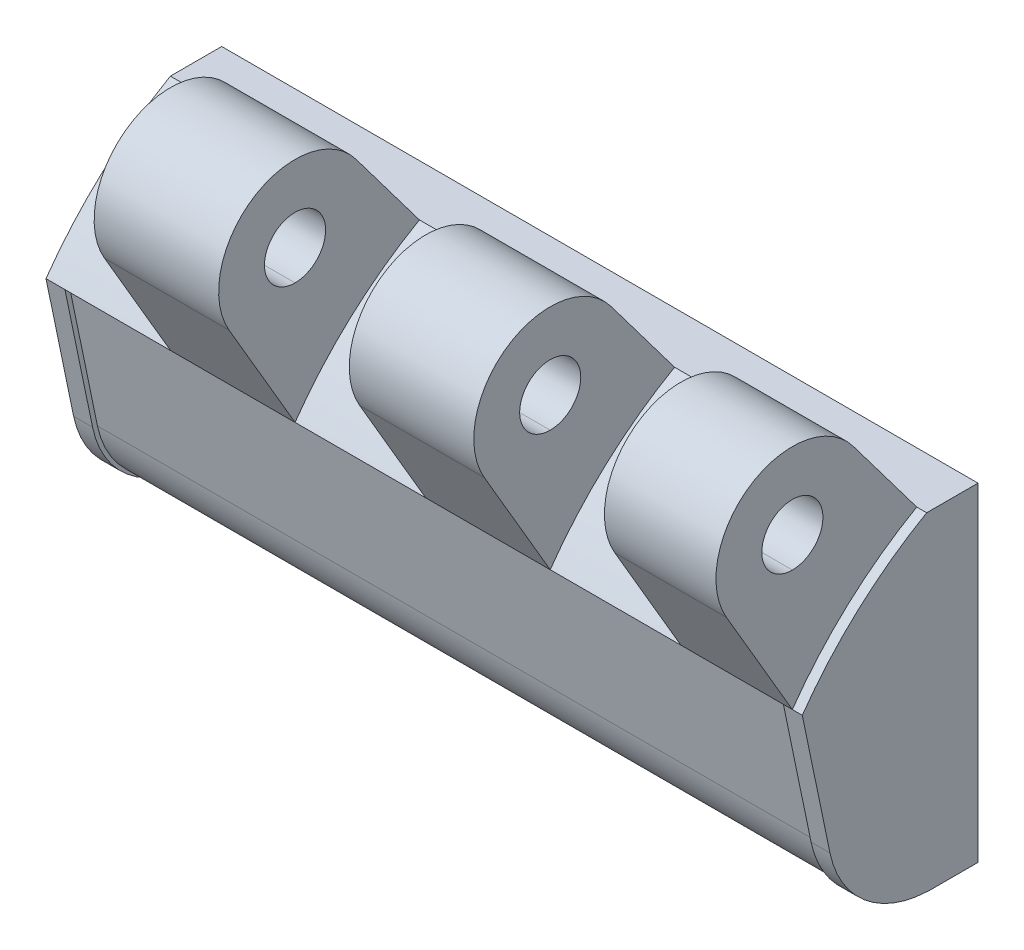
ISO-10303-21;
HEADER;
FILE_DESCRIPTION(('STEP AP214'),'2;1');
FILE_NAME('part.step','',(''),(''),'','','');
FILE_SCHEMA(('AUTOMOTIVE_DESIGN { 1 0 10303 214 1 1 1 1 }'));
ENDSEC;
DATA;
#1=APPLICATION_CONTEXT('core data for automotive mechanical design processes');
#2=APPLICATION_PROTOCOL_DEFINITION('international standard','automotive_design',2000,#1);
#3=PRODUCT_CONTEXT('',#1,'mechanical');
#4=PRODUCT('Part','Part','',(#3));
#5=PRODUCT_RELATED_PRODUCT_CATEGORY('part','',(#4));
#6=PRODUCT_DEFINITION_FORMATION('','',#4);
#7=PRODUCT_DEFINITION_CONTEXT('part definition',#1,'design');
#8=PRODUCT_DEFINITION('design','',#6,#7);
#9=PRODUCT_DEFINITION_SHAPE('','',#8);
#10=(LENGTH_UNIT() NAMED_UNIT(*) SI_UNIT(.MILLI.,.METRE.));
#11=(NAMED_UNIT(*) PLANE_ANGLE_UNIT() SI_UNIT($,.RADIAN.));
#12=(NAMED_UNIT(*) SI_UNIT($,.STERADIAN.) SOLID_ANGLE_UNIT());
#13=UNCERTAINTY_MEASURE_WITH_UNIT(LENGTH_MEASURE(1.E-05),#10,'distance_accuracy_value','');
#14=(GEOMETRIC_REPRESENTATION_CONTEXT(3) GLOBAL_UNCERTAINTY_ASSIGNED_CONTEXT((#13)) GLOBAL_UNIT_ASSIGNED_CONTEXT((#10,
#11,#12)) REPRESENTATION_CONTEXT('',''));
#15=CARTESIAN_POINT('',(0.,0.,0.));
#16=DIRECTION('',(0.,0.,1.));
#17=DIRECTION('',(1.,0.,0.));
#18=AXIS2_PLACEMENT_3D('',#15,#16,#17);
#19=CARTESIAN_POINT('',(38.63875,-2.8772598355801,8.51410225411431));
#20=DIRECTION('',(0.,0.203476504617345,-0.979079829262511));
#21=DIRECTION('',(0.,-0.979079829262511,-0.203476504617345));
#22=AXIS2_PLACEMENT_3D('',#19,#20,#21);
#23=PLANE('',#22);
#24=DIRECTION('',(-1.,0.,0.));
#25=VECTOR('',#24,1.);
#26=CARTESIAN_POINT('',(-2.45373864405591,4.25,9.99531949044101));
#27=LINE('',#26,#25);
#28=CARTESIAN_POINT('',(-2.45373864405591,4.25,9.99531949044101));
#29=VERTEX_POINT('',#28);
#30=CARTESIAN_POINT('',(2.4537386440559,4.25,9.99531949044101));
#31=VERTEX_POINT('',#30);
#32=EDGE_CURVE('E546',#29,#31,#27,.F.);
#33=ORIENTED_EDGE('',*,*,#32,.T.);
#34=DIRECTION('',(0.49209328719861,-0.852330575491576,-0.177134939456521));
#35=VECTOR('',#34,1.);
#36=CARTESIAN_POINT('',(2.4537386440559,4.25,9.99531949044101));
#37=LINE('',#36,#35);
#38=CARTESIAN_POINT('',(4.9074772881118,0.,9.11206654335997));
#39=VERTEX_POINT('',#38);
#40=EDGE_CURVE('E565',#31,#39,#37,.T.);
#41=ORIENTED_EDGE('',*,*,#40,.T.);
#42=DIRECTION('',(-0.49209328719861,-0.852330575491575,-0.177134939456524));
#43=VECTOR('',#42,1.);
#44=CARTESIAN_POINT('',(4.9074772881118,0.,9.11206654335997));
#45=LINE('',#44,#43);
#46=CARTESIAN_POINT('',(3.24629054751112,-2.8772598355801,8.51410225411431));
#47=VERTEX_POINT('',#46);
#48=EDGE_CURVE('E578',#39,#47,#45,.T.);
#49=ORIENTED_EDGE('',*,*,#48,.T.);
#50=DIRECTION('',(1.,0.,0.));
#51=VECTOR('',#50,1.);
#52=CARTESIAN_POINT('',(38.63875,-2.8772598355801,8.51410225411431));
#53=LINE('',#52,#51);
#54=CARTESIAN_POINT('',(-3.24629054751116,-2.8772598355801,8.51410225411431));
#55=VERTEX_POINT('',#54);
#56=EDGE_CURVE('E447',#47,#55,#53,.F.);
#57=ORIENTED_EDGE('',*,*,#56,.T.);
#58=DIRECTION('',(-0.49209328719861,0.852330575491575,0.177134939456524));
#59=VECTOR('',#58,1.);
#60=CARTESIAN_POINT('',(-3.24629054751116,-2.8772598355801,8.51410225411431));
#61=LINE('',#60,#59);
#62=CARTESIAN_POINT('',(-4.9074772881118,0.,9.11206654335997));
#63=VERTEX_POINT('',#62);
#64=EDGE_CURVE('E536',#55,#63,#61,.T.);
#65=ORIENTED_EDGE('',*,*,#64,.T.);
#66=DIRECTION('',(0.49209328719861,0.852330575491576,0.177134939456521));
#67=VECTOR('',#66,1.);
#68=CARTESIAN_POINT('',(-4.9074772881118,0.,9.11206654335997));
#69=LINE('',#68,#67);
#70=EDGE_CURVE('E533',#63,#29,#69,.T.);
#71=ORIENTED_EDGE('',*,*,#70,.T.);
#72=EDGE_LOOP('',(#33,#41,#49,#57,#65,#71));
#73=FACE_BOUND('',#72,.T.);
#74=ADVANCED_FACE('F14',(#73),#23,.T.);
#75=CARTESIAN_POINT('',(38.63875,-1.75,3.09));
#76=DIRECTION('',(1.,0.,0.));
#77=DIRECTION('',(0.,1.,0.));
#78=AXIS2_PLACEMENT_3D('',#75,#76,#77);
#79=CYLINDRICAL_SURFACE('',#78,5.54);
#80=DIRECTION('',(1.,0.,0.));
#81=VECTOR('',#80,1.);
#82=CARTESIAN_POINT('',(2.4537386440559,-4.25,8.03384465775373));
#83=LINE('',#82,#81);
#84=CARTESIAN_POINT('',(2.4537386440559,-4.25,8.03384465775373));
#85=VERTEX_POINT('',#84);
#86=CARTESIAN_POINT('',(-2.45373864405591,-4.25,8.03384465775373));
#87=VERTEX_POINT('',#86);
#88=EDGE_CURVE('E518',#85,#87,#83,.F.);
#89=ORIENTED_EDGE('',*,*,#88,.T.);
#90=CARTESIAN_POINT('',(-3.89711431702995,-1.75,3.09));
#91=DIRECTION('',(-0.866025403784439,-0.5,0.));
#92=DIRECTION('',(0.5,-0.866025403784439,0.));
#93=AXIS2_PLACEMENT_3D('',#90,#91,#92);
#94=ELLIPSE('',#93,6.39704098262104,5.54);
#95=EDGE_CURVE('E457',#87,#55,#94,.T.);
#96=ORIENTED_EDGE('',*,*,#95,.T.);
#97=ORIENTED_EDGE('',*,*,#56,.F.);
#98=CARTESIAN_POINT('',(3.89711431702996,-1.75,3.09));
#99=DIRECTION('',(0.866025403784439,-0.5,0.));
#100=DIRECTION('',(0.5,0.866025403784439,0.));
#101=AXIS2_PLACEMENT_3D('',#98,#99,#100);
#102=ELLIPSE('',#101,6.39704098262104,5.54);
#103=EDGE_CURVE('E520',#47,#85,#102,.T.);
#104=ORIENTED_EDGE('',*,*,#103,.T.);
#105=EDGE_LOOP('',(#89,#96,#97,#104));
#106=FACE_BOUND('',#105,.T.);
#107=ADVANCED_FACE('F836',(#106),#79,.F.);
#108=CARTESIAN_POINT('',(38.63875,-1.75,3.09));
#109=DIRECTION('',(1.,0.,0.));
#110=DIRECTION('',(0.,1.,0.));
#111=AXIS2_PLACEMENT_3D('',#108,#109,#110);
#112=CYLINDRICAL_SURFACE('',#111,5.54);
#113=DIRECTION('',(-1.,0.,0.));
#114=VECTOR('',#113,1.);
#115=CARTESIAN_POINT('',(38.63875,-2.8772598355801,8.51410225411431));
#116=LINE('',#115,#114);
#117=CARTESIAN_POINT('',(33.7462905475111,-2.8772598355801,8.51410225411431));
#118=VERTEX_POINT('',#117);
#119=CARTESIAN_POINT('',(27.2537094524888,-2.8772598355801,8.51410225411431));
#120=VERTEX_POINT('',#119);
#121=EDGE_CURVE('E444',#118,#120,#116,.T.);
#122=ORIENTED_EDGE('',*,*,#121,.F.);
#123=CARTESIAN_POINT('',(34.3971143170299,-1.75,3.09));
#124=DIRECTION('',(0.866025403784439,-0.5,0.));
#125=DIRECTION('',(0.5,0.866025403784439,0.));
#126=AXIS2_PLACEMENT_3D('',#123,#124,#125);
#127=ELLIPSE('',#126,6.39704098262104,5.54);
#128=CARTESIAN_POINT('',(32.9537386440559,-4.25,8.03384465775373));
#129=VERTEX_POINT('',#128);
#130=EDGE_CURVE('E456',#118,#129,#127,.T.);
#131=ORIENTED_EDGE('',*,*,#130,.T.);
#132=DIRECTION('',(1.,0.,0.));
#133=VECTOR('',#132,1.);
#134=CARTESIAN_POINT('',(32.9537386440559,-4.25,8.03384465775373));
#135=LINE('',#134,#133);
#136=CARTESIAN_POINT('',(28.0462613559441,-4.25,8.03384465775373));
#137=VERTEX_POINT('',#136);
#138=EDGE_CURVE('E454',#129,#137,#135,.F.);
#139=ORIENTED_EDGE('',*,*,#138,.T.);
#140=CARTESIAN_POINT('',(26.6028856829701,-1.75,3.09));
#141=DIRECTION('',(-0.866025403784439,-0.5,0.));
#142=DIRECTION('',(0.5,-0.866025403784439,0.));
#143=AXIS2_PLACEMENT_3D('',#140,#141,#142);
#144=ELLIPSE('',#143,6.39704098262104,5.54);
#145=EDGE_CURVE('E737',#137,#120,#144,.T.);
#146=ORIENTED_EDGE('',*,*,#145,.T.);
#147=EDGE_LOOP('',(#122,#131,#139,#146));
#148=FACE_BOUND('',#147,.T.);
#149=ADVANCED_FACE('F1040',(#148),#112,.F.);
#150=CARTESIAN_POINT('',(38.63875,-2.8772598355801,8.51410225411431));
#151=DIRECTION('',(0.,0.203476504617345,-0.979079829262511));
#152=DIRECTION('',(0.,-0.979079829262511,-0.203476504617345));
#153=AXIS2_PLACEMENT_3D('',#150,#151,#152);
#154=PLANE('',#153);
#155=DIRECTION('',(-0.49209328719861,-0.852330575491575,-0.177134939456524));
#156=VECTOR('',#155,1.);
#157=CARTESIAN_POINT('',(35.4074772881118,0.,9.11206654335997));
#158=LINE('',#157,#156);
#159=CARTESIAN_POINT('',(35.4074772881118,0.,9.11206654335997));
#160=VERTEX_POINT('',#159);
#161=EDGE_CURVE('E510',#160,#118,#158,.T.);
#162=ORIENTED_EDGE('',*,*,#161,.T.);
#163=ORIENTED_EDGE('',*,*,#121,.T.);
#164=DIRECTION('',(-0.492093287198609,0.852330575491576,0.177134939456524));
#165=VECTOR('',#164,1.);
#166=CARTESIAN_POINT('',(27.2537094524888,-2.8772598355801,8.51410225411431));
#167=LINE('',#166,#165);
#168=CARTESIAN_POINT('',(25.5925227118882,0.,9.11206654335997));
#169=VERTEX_POINT('',#168);
#170=EDGE_CURVE('E739',#120,#169,#167,.T.);
#171=ORIENTED_EDGE('',*,*,#170,.T.);
#172=DIRECTION('',(0.49209328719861,0.852330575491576,0.177134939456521));
#173=VECTOR('',#172,1.);
#174=CARTESIAN_POINT('',(25.5925227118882,0.,9.11206654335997));
#175=LINE('',#174,#173);
#176=CARTESIAN_POINT('',(28.0462613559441,4.25,9.99531949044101));
#177=VERTEX_POINT('',#176);
#178=EDGE_CURVE('E451',#169,#177,#175,.T.);
#179=ORIENTED_EDGE('',*,*,#178,.T.);
#180=DIRECTION('',(-1.,0.,0.));
#181=VECTOR('',#180,1.);
#182=CARTESIAN_POINT('',(28.0462613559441,4.25,9.99531949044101));
#183=LINE('',#182,#181);
#184=CARTESIAN_POINT('',(32.9537386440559,4.25,9.99531949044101));
#185=VERTEX_POINT('',#184);
#186=EDGE_CURVE('E483',#177,#185,#183,.F.);
#187=ORIENTED_EDGE('',*,*,#186,.T.);
#188=DIRECTION('',(0.49209328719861,-0.852330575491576,-0.177134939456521));
#189=VECTOR('',#188,1.);
#190=CARTESIAN_POINT('',(32.9537386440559,4.25,9.99531949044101));
#191=LINE('',#190,#189);
#192=EDGE_CURVE('E497',#185,#160,#191,.T.);
#193=ORIENTED_EDGE('',*,*,#192,.T.);
#194=EDGE_LOOP('',(#162,#163,#171,#179,#187,#193));
#195=FACE_BOUND('',#194,.T.);
#196=ADVANCED_FACE('F1042',(#195),#154,.T.);
#197=CARTESIAN_POINT('',(38.7625,-1.75,3.09));
#198=DIRECTION('',(1.,0.,0.));
#199=DIRECTION('',(0.,1.,0.));
#200=AXIS2_PLACEMENT_3D('',#197,#198,#199);
#201=CYLINDRICAL_SURFACE('',#200,5.54);
#202=CARTESIAN_POINT('',(-8.2625,-1.75,3.09));
#203=DIRECTION('',(1.,0.,0.));
#204=DIRECTION('',(0.,1.,0.));
#205=AXIS2_PLACEMENT_3D('',#202,#203,#204);
#206=CIRCLE('',#205,5.54);
#207=CARTESIAN_POINT('',(-8.2625,-7.2834549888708,3.35921345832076));
#208=VERTEX_POINT('',#207);
#209=CARTESIAN_POINT('',(-8.2625,-2.8772598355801,8.51410225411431));
#210=VERTEX_POINT('',#209);
#211=EDGE_CURVE('E734',#208,#210,#206,.F.);
#212=ORIENTED_EDGE('',*,*,#211,.F.);
#213=DIRECTION('',(1.,0.,0.));
#214=VECTOR('',#213,1.);
#215=CARTESIAN_POINT('',(38.7625,-7.2834549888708,3.35921345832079));
#216=LINE('',#215,#214);
#217=CARTESIAN_POINT('',(-8.13875,-7.2834549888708,3.35921345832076));
#218=VERTEX_POINT('',#217);
#219=EDGE_CURVE('E375',#208,#218,#216,.T.);
#220=ORIENTED_EDGE('',*,*,#219,.T.);
#221=CARTESIAN_POINT('',(-8.13875,-1.75,3.09));
#222=DIRECTION('',(1.,0.,0.));
#223=DIRECTION('',(0.,1.,0.));
#224=AXIS2_PLACEMENT_3D('',#221,#222,#223);
#225=CIRCLE('',#224,5.54);
#226=CARTESIAN_POINT('',(-8.13875,-2.8772598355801,8.51410225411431));
#227=VERTEX_POINT('',#226);
#228=EDGE_CURVE('E17',#218,#227,#225,.F.);
#229=ORIENTED_EDGE('',*,*,#228,.T.);
#230=DIRECTION('',(-1.,0.,0.));
#231=VECTOR('',#230,1.);
#232=CARTESIAN_POINT('',(38.7625,-2.8772598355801,8.51410225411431));
#233=LINE('',#232,#231);
#234=EDGE_CURVE('E363',#227,#210,#233,.T.);
#235=ORIENTED_EDGE('',*,*,#234,.T.);
#236=EDGE_LOOP('',(#212,#220,#229,#235));
#237=FACE_BOUND('',#236,.T.);
#238=ADVANCED_FACE('F378',(#237),#201,.T.);
#239=CARTESIAN_POINT('',(38.7625,-2.8772598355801,8.51410225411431));
#240=DIRECTION('',(0.,0.203476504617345,-0.979079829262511));
#241=DIRECTION('',(0.,-0.979079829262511,-0.203476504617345));
#242=AXIS2_PLACEMENT_3D('',#239,#240,#241);
#243=PLANE('',#242);
#244=DIRECTION('',(-1.,0.,0.));
#245=VECTOR('',#244,1.);
#246=CARTESIAN_POINT('',(38.7625,5.5926726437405,10.2743593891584));
#247=LINE('',#246,#245);
#248=CARTESIAN_POINT('',(-8.2625,5.5926726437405,10.2743593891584));
#249=VERTEX_POINT('',#248);
#250=CARTESIAN_POINT('',(-8.13875,5.5926726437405,10.2743593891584));
#251=VERTEX_POINT('',#250);
#252=EDGE_CURVE('E374',#249,#251,#247,.F.);
#253=ORIENTED_EDGE('',*,*,#252,.F.);
#254=DIRECTION('',(0.,0.979079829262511,0.203476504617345));
#255=VECTOR('',#254,1.);
#256=CARTESIAN_POINT('',(-8.2625,-2.8772598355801,8.51410225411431));
#257=LINE('',#256,#255);
#258=EDGE_CURVE('E370',#210,#249,#257,.T.);
#259=ORIENTED_EDGE('',*,*,#258,.F.);
#260=ORIENTED_EDGE('',*,*,#234,.F.);
#261=DIRECTION('',(0.,0.979079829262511,0.203476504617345));
#262=VECTOR('',#261,1.);
#263=CARTESIAN_POINT('',(-8.13875,-2.8772598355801,8.51410225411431));
#264=LINE('',#263,#262);
#265=EDGE_CURVE('E367',#227,#251,#264,.T.);
#266=ORIENTED_EDGE('',*,*,#265,.T.);
#267=EDGE_LOOP('',(#253,#259,#260,#266));
#268=FACE_BOUND('',#267,.T.);
#269=ADVANCED_FACE('F365',(#268),#243,.F.);
#270=CARTESIAN_POINT('',(6.8,15.5,11.5));
#271=DIRECTION('',(1.,0.,0.));
#272=DIRECTION('',(0.,1.,0.));
#273=AXIS2_PLACEMENT_3D('',#270,#271,#272);
#274=CYLINDRICAL_SURFACE('',#273,2.);
#275=CARTESIAN_POINT('',(6.8,15.5,11.5));
#276=DIRECTION('',(1.,0.,0.));
#277=DIRECTION('',(0.,1.,0.));
#278=AXIS2_PLACEMENT_3D('',#275,#276,#277);
#279=CIRCLE('',#278,2.);
#280=CARTESIAN_POINT('',(6.8,13.5,11.5));
#281=VERTEX_POINT('',#280);
#282=CARTESIAN_POINT('',(6.8,17.5,11.5));
#283=VERTEX_POINT('',#282);
#284=EDGE_CURVE('E720',#281,#283,#279,.F.);
#285=ORIENTED_EDGE('',*,*,#284,.F.);
#286=DIRECTION('',(1.,0.,0.));
#287=VECTOR('',#286,1.);
#288=CARTESIAN_POINT('',(6.8,13.5,11.5));
#289=LINE('',#288,#287);
#290=CARTESIAN_POINT('',(-1.35,13.5,11.5));
#291=VERTEX_POINT('',#290);
#292=EDGE_CURVE('E434',#281,#291,#289,.F.);
#293=ORIENTED_EDGE('',*,*,#292,.T.);
#294=CARTESIAN_POINT('',(-1.35,15.5,11.5));
#295=DIRECTION('',(1.,0.,0.));
#296=DIRECTION('',(0.,1.,0.));
#297=AXIS2_PLACEMENT_3D('',#294,#295,#296);
#298=CIRCLE('',#297,2.);
#299=CARTESIAN_POINT('',(-1.35,17.5,11.5));
#300=VERTEX_POINT('',#299);
#301=EDGE_CURVE('E732',#291,#300,#298,.F.);
#302=ORIENTED_EDGE('',*,*,#301,.T.);
#303=DIRECTION('',(1.,0.,0.));
#304=VECTOR('',#303,1.);
#305=CARTESIAN_POINT('',(6.8,17.5,11.5));
#306=LINE('',#305,#304);
#307=EDGE_CURVE('E432',#300,#283,#306,.T.);
#308=ORIENTED_EDGE('',*,*,#307,.T.);
#309=EDGE_LOOP('',(#285,#293,#302,#308));
#310=FACE_BOUND('',#309,.T.);
#311=ADVANCED_FACE('F1081',(#310),#274,.F.);
#312=CARTESIAN_POINT('',(6.8,15.5,11.5));
#313=DIRECTION('',(1.,0.,0.));
#314=DIRECTION('',(0.,1.,0.));
#315=AXIS2_PLACEMENT_3D('',#312,#313,#314);
#316=CYLINDRICAL_SURFACE('',#315,2.);
#317=CARTESIAN_POINT('',(-1.35,15.5,11.5));
#318=DIRECTION('',(1.,0.,0.));
#319=DIRECTION('',(0.,1.,0.));
#320=AXIS2_PLACEMENT_3D('',#317,#318,#319);
#321=CIRCLE('',#320,2.);
#322=EDGE_CURVE('E729',#300,#291,#321,.F.);
#323=ORIENTED_EDGE('',*,*,#322,.T.);
#324=ORIENTED_EDGE('',*,*,#292,.F.);
#325=CARTESIAN_POINT('',(6.8,15.5,11.5));
#326=DIRECTION('',(1.,0.,0.));
#327=DIRECTION('',(0.,1.,0.));
#328=AXIS2_PLACEMENT_3D('',#325,#326,#327);
#329=CIRCLE('',#328,2.);
#330=EDGE_CURVE('E717',#283,#281,#329,.F.);
#331=ORIENTED_EDGE('',*,*,#330,.F.);
#332=ORIENTED_EDGE('',*,*,#307,.F.);
#333=EDGE_LOOP('',(#323,#324,#331,#332));
#334=FACE_BOUND('',#333,.T.);
#335=ADVANCED_FACE('F1090',(#334),#316,.F.);
#336=CARTESIAN_POINT('',(15.35,15.5,11.5));
#337=DIRECTION('',(-1.,0.,0.));
#338=DIRECTION('',(0.,-1.,0.));
#339=AXIS2_PLACEMENT_3D('',#336,#337,#338);
#340=CYLINDRICAL_SURFACE('',#339,2.);
#341=CARTESIAN_POINT('',(23.5,15.5,11.5));
#342=DIRECTION('',(-1.,0.,0.));
#343=DIRECTION('',(0.,-1.,0.));
#344=AXIS2_PLACEMENT_3D('',#341,#342,#343);
#345=CIRCLE('',#344,2.);
#346=CARTESIAN_POINT('',(23.5,13.5,11.5));
#347=VERTEX_POINT('',#346);
#348=CARTESIAN_POINT('',(23.5,17.5,11.5));
#349=VERTEX_POINT('',#348);
#350=EDGE_CURVE('E427',#347,#349,#345,.T.);
#351=ORIENTED_EDGE('',*,*,#350,.F.);
#352=DIRECTION('',(-1.,0.,0.));
#353=VECTOR('',#352,1.);
#354=CARTESIAN_POINT('',(15.35,13.5,11.5));
#355=LINE('',#354,#353);
#356=CARTESIAN_POINT('',(15.35,13.5,11.5));
#357=VERTEX_POINT('',#356);
#358=EDGE_CURVE('E430',#347,#357,#355,.T.);
#359=ORIENTED_EDGE('',*,*,#358,.T.);
#360=CARTESIAN_POINT('',(15.35,15.5,11.5));
#361=DIRECTION('',(-1.,0.,0.));
#362=DIRECTION('',(0.,-1.,0.));
#363=AXIS2_PLACEMENT_3D('',#360,#361,#362);
#364=CIRCLE('',#363,2.);
#365=CARTESIAN_POINT('',(15.35,17.5,11.5));
#366=VERTEX_POINT('',#365);
#367=EDGE_CURVE('E710',#357,#366,#364,.T.);
#368=ORIENTED_EDGE('',*,*,#367,.T.);
#369=DIRECTION('',(-1.,0.,0.));
#370=VECTOR('',#369,1.);
#371=CARTESIAN_POINT('',(15.35,17.5,11.5));
#372=LINE('',#371,#370);
#373=EDGE_CURVE('E420',#366,#349,#372,.F.);
#374=ORIENTED_EDGE('',*,*,#373,.T.);
#375=EDGE_LOOP('',(#351,#359,#368,#374));
#376=FACE_BOUND('',#375,.T.);
#377=ADVANCED_FACE('F1100',(#376),#340,.F.);
#378=CARTESIAN_POINT('',(15.35,15.5,11.5));
#379=DIRECTION('',(-1.,0.,0.));
#380=DIRECTION('',(0.,-1.,0.));
#381=AXIS2_PLACEMENT_3D('',#378,#379,#380);
#382=CYLINDRICAL_SURFACE('',#381,2.);
#383=CARTESIAN_POINT('',(15.35,15.5,11.5));
#384=DIRECTION('',(-1.,0.,0.));
#385=DIRECTION('',(0.,-1.,0.));
#386=AXIS2_PLACEMENT_3D('',#383,#384,#385);
#387=CIRCLE('',#386,2.);
#388=EDGE_CURVE('E713',#366,#357,#387,.T.);
#389=ORIENTED_EDGE('',*,*,#388,.T.);
#390=ORIENTED_EDGE('',*,*,#358,.F.);
#391=CARTESIAN_POINT('',(23.5,15.5,11.5));
#392=DIRECTION('',(-1.,0.,0.));
#393=DIRECTION('',(0.,-1.,0.));
#394=AXIS2_PLACEMENT_3D('',#391,#392,#393);
#395=CIRCLE('',#394,2.);
#396=EDGE_CURVE('E703',#349,#347,#395,.T.);
#397=ORIENTED_EDGE('',*,*,#396,.F.);
#398=ORIENTED_EDGE('',*,*,#373,.F.);
#399=EDGE_LOOP('',(#389,#390,#397,#398));
#400=FACE_BOUND('',#399,.T.);
#401=ADVANCED_FACE('F1110',(#400),#382,.F.);
#402=CARTESIAN_POINT('',(6.8,12.9766151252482,15.8165412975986));
#403=DIRECTION('',(0.,-0.504676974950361,0.863308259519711));
#404=DIRECTION('',(0.,0.863308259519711,0.504676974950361));
#405=AXIS2_PLACEMENT_3D('',#402,#403,#404);
#406=PLANE('',#405);
#407=DIRECTION('',(0.,-0.863308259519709,-0.504676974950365));
#408=VECTOR('',#407,1.);
#409=CARTESIAN_POINT('',(6.8,12.9766151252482,15.8165412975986));
#410=LINE('',#409,#408);
#411=CARTESIAN_POINT('',(6.8,12.9766151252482,15.8165412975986));
#412=VERTEX_POINT('',#411);
#413=CARTESIAN_POINT('',(6.8,5.59267264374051,11.5));
#414=VERTEX_POINT('',#413);
#415=EDGE_CURVE('E723',#412,#414,#410,.T.);
#416=ORIENTED_EDGE('',*,*,#415,.F.);
#417=DIRECTION('',(1.,0.,0.));
#418=VECTOR('',#417,1.);
#419=CARTESIAN_POINT('',(6.8,12.9766151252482,15.8165412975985));
#420=LINE('',#419,#418);
#421=CARTESIAN_POINT('',(-1.35,12.9766151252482,15.8165412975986));
#422=VERTEX_POINT('',#421);
#423=EDGE_CURVE('E436',#422,#412,#420,.T.);
#424=ORIENTED_EDGE('',*,*,#423,.F.);
#425=DIRECTION('',(0.,-0.863308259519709,-0.504676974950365));
#426=VECTOR('',#425,1.);
#427=CARTESIAN_POINT('',(-1.35,12.9766151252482,15.8165412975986));
#428=LINE('',#427,#426);
#429=CARTESIAN_POINT('',(-1.35,5.59267264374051,11.5));
#430=VERTEX_POINT('',#429);
#431=EDGE_CURVE('E728',#422,#430,#428,.T.);
#432=ORIENTED_EDGE('',*,*,#431,.T.);
#433=DIRECTION('',(-1.,0.,0.));
#434=VECTOR('',#433,1.);
#435=CARTESIAN_POINT('',(38.7625,5.5926726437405,11.5));
#436=LINE('',#435,#434);
#437=EDGE_CURVE('E1550',#430,#414,#436,.F.);
#438=ORIENTED_EDGE('',*,*,#437,.T.);
#439=EDGE_LOOP('',(#416,#424,#432,#438));
#440=FACE_BOUND('',#439,.T.);
#441=ADVANCED_FACE('F1120',(#440),#406,.T.);
#442=CARTESIAN_POINT('',(15.35,5.5926726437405,11.5));
#443=DIRECTION('',(0.,-0.504676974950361,0.863308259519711));
#444=DIRECTION('',(0.,0.863308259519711,0.504676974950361));
#445=AXIS2_PLACEMENT_3D('',#442,#443,#444);
#446=PLANE('',#445);
#447=DIRECTION('',(0.,-0.863308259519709,-0.504676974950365));
#448=VECTOR('',#447,1.);
#449=CARTESIAN_POINT('',(15.35,12.9766151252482,15.8165412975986));
#450=LINE('',#449,#448);
#451=CARTESIAN_POINT('',(15.35,12.9766151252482,15.8165412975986));
#452=VERTEX_POINT('',#451);
#453=CARTESIAN_POINT('',(15.35,5.59267264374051,11.5));
#454=VERTEX_POINT('',#453);
#455=EDGE_CURVE('E716',#452,#454,#450,.T.);
#456=ORIENTED_EDGE('',*,*,#455,.T.);
#457=DIRECTION('',(-1.,0.,0.));
#458=VECTOR('',#457,1.);
#459=CARTESIAN_POINT('',(38.7625,5.5926726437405,11.5));
#460=LINE('',#459,#458);
#461=CARTESIAN_POINT('',(23.5,5.59267264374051,11.5));
#462=VERTEX_POINT('',#461);
#463=EDGE_CURVE('E1548',#454,#462,#460,.F.);
#464=ORIENTED_EDGE('',*,*,#463,.T.);
#465=DIRECTION('',(0.,-0.863308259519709,-0.504676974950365));
#466=VECTOR('',#465,1.);
#467=CARTESIAN_POINT('',(23.5,12.9766151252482,15.8165412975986));
#468=LINE('',#467,#466);
#469=CARTESIAN_POINT('',(23.5,12.9766151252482,15.8165412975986));
#470=VERTEX_POINT('',#469);
#471=EDGE_CURVE('E702',#470,#462,#468,.T.);
#472=ORIENTED_EDGE('',*,*,#471,.F.);
#473=DIRECTION('',(-1.,0.,0.));
#474=VECTOR('',#473,1.);
#475=CARTESIAN_POINT('',(15.35,12.9766151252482,15.8165412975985));
#476=LINE('',#475,#474);
#477=EDGE_CURVE('E425',#452,#470,#476,.F.);
#478=ORIENTED_EDGE('',*,*,#477,.F.);
#479=EDGE_LOOP('',(#456,#464,#472,#478));
#480=FACE_BOUND('',#479,.T.);
#481=ADVANCED_FACE('F1130',(#480),#446,.T.);
#482=CARTESIAN_POINT('',(32.05,15.5,11.5));
#483=DIRECTION('',(-1.,0.,0.));
#484=DIRECTION('',(0.,-1.,0.));
#485=AXIS2_PLACEMENT_3D('',#482,#483,#484);
#486=CYLINDRICAL_SURFACE('',#485,2.);
#487=CARTESIAN_POINT('',(39.35,15.5,11.5));
#488=DIRECTION('',(-1.,0.,0.));
#489=DIRECTION('',(0.,-1.,0.));
#490=AXIS2_PLACEMENT_3D('',#487,#488,#489);
#491=CIRCLE('',#490,2.);
#492=CARTESIAN_POINT('',(39.35,13.5,11.5));
#493=VERTEX_POINT('',#492);
#494=CARTESIAN_POINT('',(39.35,17.5,11.5));
#495=VERTEX_POINT('',#494);
#496=EDGE_CURVE('E415',#493,#495,#491,.T.);
#497=ORIENTED_EDGE('',*,*,#496,.F.);
#498=DIRECTION('',(-1.,0.,0.));
#499=VECTOR('',#498,1.);
#500=CARTESIAN_POINT('',(32.05,13.5,11.5));
#501=LINE('',#500,#499);
#502=CARTESIAN_POINT('',(32.05,13.5,11.5));
#503=VERTEX_POINT('',#502);
#504=EDGE_CURVE('E418',#493,#503,#501,.T.);
#505=ORIENTED_EDGE('',*,*,#504,.T.);
#506=CARTESIAN_POINT('',(32.05,15.5,11.5));
#507=DIRECTION('',(-1.,0.,0.));
#508=DIRECTION('',(0.,-1.,0.));
#509=AXIS2_PLACEMENT_3D('',#506,#507,#508);
#510=CIRCLE('',#509,2.);
#511=CARTESIAN_POINT('',(32.05,17.5,11.5));
#512=VERTEX_POINT('',#511);
#513=EDGE_CURVE('E693',#503,#512,#510,.T.);
#514=ORIENTED_EDGE('',*,*,#513,.T.);
#515=DIRECTION('',(-1.,0.,0.));
#516=VECTOR('',#515,1.);
#517=CARTESIAN_POINT('',(32.05,17.5,11.5));
#518=LINE('',#517,#516);
#519=EDGE_CURVE('E410',#512,#495,#518,.F.);
#520=ORIENTED_EDGE('',*,*,#519,.T.);
#521=EDGE_LOOP('',(#497,#505,#514,#520));
#522=FACE_BOUND('',#521,.T.);
#523=ADVANCED_FACE('F1140',(#522),#486,.F.);
#524=CARTESIAN_POINT('',(32.05,15.5,11.5));
#525=DIRECTION('',(-1.,0.,0.));
#526=DIRECTION('',(0.,-1.,0.));
#527=AXIS2_PLACEMENT_3D('',#524,#525,#526);
#528=CYLINDRICAL_SURFACE('',#527,2.);
#529=CARTESIAN_POINT('',(32.05,15.5,11.5));
#530=DIRECTION('',(-1.,0.,0.));
#531=DIRECTION('',(0.,-1.,0.));
#532=AXIS2_PLACEMENT_3D('',#529,#530,#531);
#533=CIRCLE('',#532,2.);
#534=EDGE_CURVE('E696',#512,#503,#533,.T.);
#535=ORIENTED_EDGE('',*,*,#534,.T.);
#536=ORIENTED_EDGE('',*,*,#504,.F.);
#537=CARTESIAN_POINT('',(39.35,15.5,11.5));
#538=DIRECTION('',(-1.,0.,0.));
#539=DIRECTION('',(0.,-1.,0.));
#540=AXIS2_PLACEMENT_3D('',#537,#538,#539);
#541=CIRCLE('',#540,2.);
#542=EDGE_CURVE('E686',#495,#493,#541,.T.);
#543=ORIENTED_EDGE('',*,*,#542,.F.);
#544=ORIENTED_EDGE('',*,*,#519,.F.);
#545=EDGE_LOOP('',(#535,#536,#543,#544));
#546=FACE_BOUND('',#545,.T.);
#547=ADVANCED_FACE('F1150',(#546),#528,.F.);
#548=CARTESIAN_POINT('',(32.05,5.5926726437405,11.5));
#549=DIRECTION('',(0.,-0.504676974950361,0.863308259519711));
#550=DIRECTION('',(0.,0.863308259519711,0.504676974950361));
#551=AXIS2_PLACEMENT_3D('',#548,#549,#550);
#552=PLANE('',#551);
#553=DIRECTION('',(-1.,0.,0.));
#554=VECTOR('',#553,1.);
#555=CARTESIAN_POINT('',(38.7625,5.5926726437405,11.5));
#556=LINE('',#555,#554);
#557=CARTESIAN_POINT('',(32.05,5.59267264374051,11.5));
#558=VERTEX_POINT('',#557);
#559=CARTESIAN_POINT('',(38.7625,5.5926726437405,11.5));
#560=VERTEX_POINT('',#559);
#561=EDGE_CURVE('E403',#558,#560,#556,.F.);
#562=ORIENTED_EDGE('',*,*,#561,.T.);
#563=DIRECTION('',(-1.,0.,0.));
#564=VECTOR('',#563,1.);
#565=CARTESIAN_POINT('',(32.05,5.5926726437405,11.5));
#566=LINE('',#565,#564);
#567=CARTESIAN_POINT('',(39.35,5.59267264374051,11.5));
#568=VERTEX_POINT('',#567);
#569=EDGE_CURVE('E408',#560,#568,#566,.F.);
#570=ORIENTED_EDGE('',*,*,#569,.T.);
#571=DIRECTION('',(0.,-0.863308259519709,-0.504676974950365));
#572=VECTOR('',#571,1.);
#573=CARTESIAN_POINT('',(39.35,12.9766151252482,15.8165412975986));
#574=LINE('',#573,#572);
#575=CARTESIAN_POINT('',(39.35,12.9766151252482,15.8165412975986));
#576=VERTEX_POINT('',#575);
#577=EDGE_CURVE('E685',#576,#568,#574,.T.);
#578=ORIENTED_EDGE('',*,*,#577,.F.);
#579=DIRECTION('',(-1.,0.,0.));
#580=VECTOR('',#579,1.);
#581=CARTESIAN_POINT('',(32.05,12.9766151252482,15.8165412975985));
#582=LINE('',#581,#580);
#583=CARTESIAN_POINT('',(32.05,12.9766151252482,15.8165412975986));
#584=VERTEX_POINT('',#583);
#585=EDGE_CURVE('E413',#584,#576,#582,.F.);
#586=ORIENTED_EDGE('',*,*,#585,.F.);
#587=DIRECTION('',(0.,-0.863308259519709,-0.504676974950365));
#588=VECTOR('',#587,1.);
#589=CARTESIAN_POINT('',(32.05,12.9766151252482,15.8165412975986));
#590=LINE('',#589,#588);
#591=EDGE_CURVE('E590',#584,#558,#590,.T.);
#592=ORIENTED_EDGE('',*,*,#591,.T.);
#593=EDGE_LOOP('',(#562,#570,#578,#586,#592));
#594=FACE_BOUND('',#593,.T.);
#595=ADVANCED_FACE('F1160',(#594),#552,.T.);
#596=CARTESIAN_POINT('',(38.7625,-1.75,3.09));
#597=DIRECTION('',(1.,0.,0.));
#598=DIRECTION('',(0.,1.,0.));
#599=AXIS2_PLACEMENT_3D('',#596,#597,#598);
#600=CYLINDRICAL_SURFACE('',#599,5.54);
#601=CARTESIAN_POINT('',(38.7625,-1.75,3.09));
#602=DIRECTION('',(1.,0.,0.));
#603=DIRECTION('',(0.,1.,0.));
#604=AXIS2_PLACEMENT_3D('',#601,#602,#603);
#605=CIRCLE('',#604,5.54);
#606=CARTESIAN_POINT('',(38.7625,-7.2834549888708,3.35921345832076));
#607=VERTEX_POINT('',#606);
#608=CARTESIAN_POINT('',(38.7625,-2.8772598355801,8.51410225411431));
#609=VERTEX_POINT('',#608);
#610=EDGE_CURVE('E678',#607,#609,#605,.F.);
#611=ORIENTED_EDGE('',*,*,#610,.T.);
#612=DIRECTION('',(-1.,0.,0.));
#613=VECTOR('',#612,1.);
#614=CARTESIAN_POINT('',(38.7625,-2.8772598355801,8.51410225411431));
#615=LINE('',#614,#613);
#616=CARTESIAN_POINT('',(38.63875,-2.8772598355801,8.51410225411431));
#617=VERTEX_POINT('',#616);
#618=EDGE_CURVE('E384',#609,#617,#615,.T.);
#619=ORIENTED_EDGE('',*,*,#618,.T.);
#620=CARTESIAN_POINT('',(38.63875,-1.75,3.09));
#621=DIRECTION('',(1.,0.,0.));
#622=DIRECTION('',(0.,1.,0.));
#623=AXIS2_PLACEMENT_3D('',#620,#621,#622);
#624=CIRCLE('',#623,5.54);
#625=CARTESIAN_POINT('',(38.63875,-7.2834549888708,3.35921345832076));
#626=VERTEX_POINT('',#625);
#627=EDGE_CURVE('E745',#626,#617,#624,.F.);
#628=ORIENTED_EDGE('',*,*,#627,.F.);
#629=DIRECTION('',(1.,0.,0.));
#630=VECTOR('',#629,1.);
#631=CARTESIAN_POINT('',(38.7625,-7.2834549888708,3.35921345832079));
#632=LINE('',#631,#630);
#633=EDGE_CURVE('E387',#626,#607,#632,.T.);
#634=ORIENTED_EDGE('',*,*,#633,.T.);
#635=EDGE_LOOP('',(#611,#619,#628,#634));
#636=FACE_BOUND('',#635,.T.);
#637=ADVANCED_FACE('F1170',(#636),#600,.T.);
#638=CARTESIAN_POINT('',(38.7625,-2.8772598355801,8.51410225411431));
#639=DIRECTION('',(0.,0.203476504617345,-0.979079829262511));
#640=DIRECTION('',(0.,-0.979079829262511,-0.203476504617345));
#641=AXIS2_PLACEMENT_3D('',#638,#639,#640);
#642=PLANE('',#641);
#643=ORIENTED_EDGE('',*,*,#618,.F.);
#644=DIRECTION('',(0.,0.979079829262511,0.203476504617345));
#645=VECTOR('',#644,1.);
#646=CARTESIAN_POINT('',(38.7625,-2.8772598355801,8.51410225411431));
#647=LINE('',#646,#645);
#648=CARTESIAN_POINT('',(38.7625,5.5926726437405,10.2743593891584));
#649=VERTEX_POINT('',#648);
#650=EDGE_CURVE('E680',#609,#649,#647,.T.);
#651=ORIENTED_EDGE('',*,*,#650,.T.);
#652=DIRECTION('',(-1.,0.,0.));
#653=VECTOR('',#652,1.);
#654=CARTESIAN_POINT('',(38.7625,5.5926726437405,10.2743593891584));
#655=LINE('',#654,#653);
#656=CARTESIAN_POINT('',(38.63875,5.5926726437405,10.2743593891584));
#657=VERTEX_POINT('',#656);
#658=EDGE_CURVE('E400',#649,#657,#655,.T.);
#659=ORIENTED_EDGE('',*,*,#658,.T.);
#660=DIRECTION('',(0.,0.979079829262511,0.203476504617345));
#661=VECTOR('',#660,1.);
#662=CARTESIAN_POINT('',(38.63875,-2.8772598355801,8.51410225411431));
#663=LINE('',#662,#661);
#664=EDGE_CURVE('E397',#617,#657,#663,.T.);
#665=ORIENTED_EDGE('',*,*,#664,.F.);
#666=EDGE_LOOP('',(#643,#651,#659,#665));
#667=FACE_BOUND('',#666,.T.);
#668=ADVANCED_FACE('F1180',(#667),#642,.F.);
#669=CARTESIAN_POINT('',(-8.13875,15.5,0.));
#670=DIRECTION('',(1.,0.,0.));
#671=DIRECTION('',(0.,1.,0.));
#672=AXIS2_PLACEMENT_3D('',#669,#670,#671);
#673=PLANE('',#672);
#674=DIRECTION('',(0.,1.,0.));
#675=VECTOR('',#674,1.);
#676=CARTESIAN_POINT('',(-8.13875,15.5,3.35921345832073));
#677=LINE('',#676,#675);
#678=CARTESIAN_POINT('',(-8.13875,-8.2844566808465,3.35921345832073));
#679=VERTEX_POINT('',#678);
#680=EDGE_CURVE('E357',#679,#218,#677,.T.);
#681=ORIENTED_EDGE('',*,*,#680,.F.);
#682=CARTESIAN_POINT('',(-8.13875,-1.75,3.09));
#683=DIRECTION('',(1.,0.,0.));
#684=DIRECTION('',(0.,1.,0.));
#685=AXIS2_PLACEMENT_3D('',#682,#683,#684);
#686=CIRCLE('',#685,6.54);
#687=CARTESIAN_POINT('',(-8.13875,-3.0807363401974,9.49318208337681));
#688=VERTEX_POINT('',#687);
#689=EDGE_CURVE('E674',#688,#679,#686,.T.);
#690=ORIENTED_EDGE('',*,*,#689,.F.);
#691=DIRECTION('',(0.,0.979079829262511,0.203476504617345));
#692=VECTOR('',#691,1.);
#693=CARTESIAN_POINT('',(-8.13875,5.5926726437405,11.2957265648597));
#694=LINE('',#693,#692);
#695=CARTESIAN_POINT('',(-8.13875,5.5926726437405,11.2957265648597));
#696=VERTEX_POINT('',#695);
#697=EDGE_CURVE('E393',#696,#688,#694,.F.);
#698=ORIENTED_EDGE('',*,*,#697,.F.);
#699=DIRECTION('',(0.,0.,1.));
#700=VECTOR('',#699,1.);
#701=CARTESIAN_POINT('',(-8.13875,5.5926726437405,10.2743593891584));
#702=LINE('',#701,#700);
#703=EDGE_CURVE('E383',#696,#251,#702,.F.);
#704=ORIENTED_EDGE('',*,*,#703,.T.);
#705=ORIENTED_EDGE('',*,*,#265,.F.);
#706=ORIENTED_EDGE('',*,*,#228,.F.);
#707=EDGE_LOOP('',(#681,#690,#698,#704,#705,#706));
#708=FACE_BOUND('',#707,.T.);
#709=ADVANCED_FACE('F381',(#708),#673,.F.);
#710=CARTESIAN_POINT('',(38.63875,15.5,0.));
#711=DIRECTION('',(1.,0.,0.));
#712=DIRECTION('',(0.,1.,0.));
#713=AXIS2_PLACEMENT_3D('',#710,#711,#712);
#714=PLANE('',#713);
#715=DIRECTION('',(0.,0.979079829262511,0.203476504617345));
#716=VECTOR('',#715,1.);
#717=CARTESIAN_POINT('',(38.63875,5.5926726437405,11.2957265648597));
#718=LINE('',#717,#716);
#719=CARTESIAN_POINT('',(38.63875,-3.0807363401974,9.49318208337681));
#720=VERTEX_POINT('',#719);
#721=CARTESIAN_POINT('',(38.63875,5.5926726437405,11.2957265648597));
#722=VERTEX_POINT('',#721);
#723=EDGE_CURVE('E396',#720,#722,#718,.T.);
#724=ORIENTED_EDGE('',*,*,#723,.F.);
#725=CARTESIAN_POINT('',(38.63875,-1.75,3.09));
#726=DIRECTION('',(1.,0.,0.));
#727=DIRECTION('',(0.,1.,0.));
#728=AXIS2_PLACEMENT_3D('',#725,#726,#727);
#729=CIRCLE('',#728,6.54);
#730=CARTESIAN_POINT('',(38.63875,-8.2844566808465,3.35921345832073));
#731=VERTEX_POINT('',#730);
#732=EDGE_CURVE('E671',#731,#720,#729,.F.);
#733=ORIENTED_EDGE('',*,*,#732,.F.);
#734=DIRECTION('',(0.,1.,0.));
#735=VECTOR('',#734,1.);
#736=CARTESIAN_POINT('',(38.63875,15.5,3.35921345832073));
#737=LINE('',#736,#735);
#738=EDGE_CURVE('E380',#731,#626,#737,.T.);
#739=ORIENTED_EDGE('',*,*,#738,.T.);
#740=ORIENTED_EDGE('',*,*,#627,.T.);
#741=ORIENTED_EDGE('',*,*,#664,.T.);
#742=DIRECTION('',(0.,0.,1.));
#743=VECTOR('',#742,1.);
#744=CARTESIAN_POINT('',(38.63875,5.5926726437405,10.2743593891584));
#745=LINE('',#744,#743);
#746=EDGE_CURVE('E402',#657,#722,#745,.T.);
#747=ORIENTED_EDGE('',*,*,#746,.T.);
#748=EDGE_LOOP('',(#724,#733,#739,#740,#741,#747));
#749=FACE_BOUND('',#748,.T.);
#750=ADVANCED_FACE('F1199',(#749),#714,.T.);
#751=CARTESIAN_POINT('',(38.63875,5.5926726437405,11.2957265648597));
#752=DIRECTION('',(0.,-0.203476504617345,0.979079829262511));
#753=DIRECTION('',(0.,0.979079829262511,0.203476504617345));
#754=AXIS2_PLACEMENT_3D('',#751,#752,#753);
#755=PLANE('',#754);
#756=ORIENTED_EDGE('',*,*,#723,.T.);
#757=DIRECTION('',(-1.,0.,0.));
#758=VECTOR('',#757,1.);
#759=CARTESIAN_POINT('',(38.7625,5.5926726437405,11.2957265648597));
#760=LINE('',#759,#758);
#761=EDGE_CURVE('E422',#722,#696,#760,.T.);
#762=ORIENTED_EDGE('',*,*,#761,.T.);
#763=ORIENTED_EDGE('',*,*,#697,.T.);
#764=DIRECTION('',(1.,0.,0.));
#765=VECTOR('',#764,1.);
#766=CARTESIAN_POINT('',(38.63875,-3.0807363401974,9.49318208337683));
#767=LINE('',#766,#765);
#768=EDGE_CURVE('E525',#720,#688,#767,.F.);
#769=ORIENTED_EDGE('',*,*,#768,.F.);
#770=EDGE_LOOP('',(#756,#762,#763,#769));
#771=FACE_BOUND('',#770,.T.);
#772=ADVANCED_FACE('F766',(#771),#755,.T.);
#773=CARTESIAN_POINT('',(2.4537386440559,-4.25,2.2));
#774=DIRECTION('',(0.,-1.,0.));
#775=DIRECTION('',(1.,0.,0.));
#776=AXIS2_PLACEMENT_3D('',#773,#774,#775);
#777=PLANE('',#776);
#778=DIRECTION('',(0.,0.,1.));
#779=VECTOR('',#778,1.);
#780=CARTESIAN_POINT('',(2.4537386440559,-4.25,2.2));
#781=LINE('',#780,#779);
#782=CARTESIAN_POINT('',(2.4537386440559,-4.25,2.2));
#783=VERTEX_POINT('',#782);
#784=EDGE_CURVE('E744',#85,#783,#781,.F.);
#785=ORIENTED_EDGE('',*,*,#784,.T.);
#786=DIRECTION('',(-1.,0.,0.));
#787=VECTOR('',#786,1.);
#788=CARTESIAN_POINT('',(15.25,-4.25,2.2));
#789=LINE('',#788,#787);
#790=CARTESIAN_POINT('',(-2.45373864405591,-4.25,2.2));
#791=VERTEX_POINT('',#790);
#792=EDGE_CURVE('E521',#791,#783,#789,.F.);
#793=ORIENTED_EDGE('',*,*,#792,.F.);
#794=DIRECTION('',(0.,0.,1.));
#795=VECTOR('',#794,1.);
#796=CARTESIAN_POINT('',(-2.45373864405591,-4.25,2.2));
#797=LINE('',#796,#795);
#798=EDGE_CURVE('E542',#791,#87,#797,.T.);
#799=ORIENTED_EDGE('',*,*,#798,.T.);
#800=ORIENTED_EDGE('',*,*,#88,.F.);
#801=EDGE_LOOP('',(#785,#793,#799,#800));
#802=FACE_BOUND('',#801,.T.);
#803=ADVANCED_FACE('F818',(#802),#777,.F.);
#804=CARTESIAN_POINT('',(4.9074772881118,0.,2.2));
#805=DIRECTION('',(0.866025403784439,-0.5,0.));
#806=DIRECTION('',(0.5,0.866025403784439,0.));
#807=AXIS2_PLACEMENT_3D('',#804,#805,#806);
#808=PLANE('',#807);
#809=DIRECTION('',(0.,0.,1.));
#810=VECTOR('',#809,1.);
#811=CARTESIAN_POINT('',(4.9074772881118,0.,2.2));
#812=LINE('',#811,#810);
#813=CARTESIAN_POINT('',(4.9074772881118,0.,2.2));
#814=VERTEX_POINT('',#813);
#815=EDGE_CURVE('E570',#39,#814,#812,.F.);
#816=ORIENTED_EDGE('',*,*,#815,.T.);
#817=DIRECTION('',(0.5,0.86602540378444,0.));
#818=VECTOR('',#817,1.);
#819=CARTESIAN_POINT('',(2.4537386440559,-4.25,2.2));
#820=LINE('',#819,#818);
#821=EDGE_CURVE('E524',#783,#814,#820,.T.);
#822=ORIENTED_EDGE('',*,*,#821,.F.);
#823=ORIENTED_EDGE('',*,*,#784,.F.);
#824=ORIENTED_EDGE('',*,*,#103,.F.);
#825=ORIENTED_EDGE('',*,*,#48,.F.);
#826=EDGE_LOOP('',(#816,#822,#823,#824,#825));
#827=FACE_BOUND('',#826,.T.);
#828=ADVANCED_FACE('F822',(#827),#808,.F.);
#829=CARTESIAN_POINT('',(2.4537386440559,4.25,2.2));
#830=DIRECTION('',(0.866025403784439,0.5,0.));
#831=DIRECTION('',(-0.5,0.866025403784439,0.));
#832=AXIS2_PLACEMENT_3D('',#829,#830,#831);
#833=PLANE('',#832);
#834=DIRECTION('',(0.,0.,1.));
#835=VECTOR('',#834,1.);
#836=CARTESIAN_POINT('',(2.4537386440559,4.25,2.2));
#837=LINE('',#836,#835);
#838=CARTESIAN_POINT('',(2.4537386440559,4.25,2.2));
#839=VERTEX_POINT('',#838);
#840=EDGE_CURVE('E551',#31,#839,#837,.F.);
#841=ORIENTED_EDGE('',*,*,#840,.T.);
#842=DIRECTION('',(-0.5,0.86602540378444,0.));
#843=VECTOR('',#842,1.);
#844=CARTESIAN_POINT('',(4.9074772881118,0.,2.2));
#845=LINE('',#844,#843);
#846=EDGE_CURVE('E561',#814,#839,#845,.T.);
#847=ORIENTED_EDGE('',*,*,#846,.F.);
#848=ORIENTED_EDGE('',*,*,#815,.F.);
#849=ORIENTED_EDGE('',*,*,#40,.F.);
#850=EDGE_LOOP('',(#841,#847,#848,#849));
#851=FACE_BOUND('',#850,.T.);
#852=ADVANCED_FACE('F840',(#851),#833,.F.);
#853=CARTESIAN_POINT('',(-2.45373864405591,4.25,2.2));
#854=DIRECTION('',(0.,1.,0.));
#855=DIRECTION('',(-1.,0.,0.));
#856=AXIS2_PLACEMENT_3D('',#853,#854,#855);
#857=PLANE('',#856);
#858=DIRECTION('',(0.,0.,1.));
#859=VECTOR('',#858,1.);
#860=CARTESIAN_POINT('',(-2.45373864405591,4.25,2.2));
#861=LINE('',#860,#859);
#862=CARTESIAN_POINT('',(-2.45373864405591,4.25,2.2));
#863=VERTEX_POINT('',#862);
#864=EDGE_CURVE('E537',#29,#863,#861,.F.);
#865=ORIENTED_EDGE('',*,*,#864,.T.);
#866=DIRECTION('',(-1.,0.,0.));
#867=VECTOR('',#866,1.);
#868=CARTESIAN_POINT('',(15.25,4.25,2.2));
#869=LINE('',#868,#867);
#870=EDGE_CURVE('E556',#839,#863,#869,.T.);
#871=ORIENTED_EDGE('',*,*,#870,.F.);
#872=ORIENTED_EDGE('',*,*,#840,.F.);
#873=ORIENTED_EDGE('',*,*,#32,.F.);
#874=EDGE_LOOP('',(#865,#871,#872,#873));
#875=FACE_BOUND('',#874,.T.);
#876=ADVANCED_FACE('F843',(#875),#857,.F.);
#877=CARTESIAN_POINT('',(-4.9074772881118,0.,2.2));
#878=DIRECTION('',(-0.866025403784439,0.5,0.));
#879=DIRECTION('',(-0.5,-0.866025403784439,0.));
#880=AXIS2_PLACEMENT_3D('',#877,#878,#879);
#881=PLANE('',#880);
#882=DIRECTION('',(0.,0.,1.));
#883=VECTOR('',#882,1.);
#884=CARTESIAN_POINT('',(-4.9074772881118,0.,2.2));
#885=LINE('',#884,#883);
#886=CARTESIAN_POINT('',(-4.9074772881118,0.,2.2));
#887=VERTEX_POINT('',#886);
#888=EDGE_CURVE('E540',#63,#887,#885,.F.);
#889=ORIENTED_EDGE('',*,*,#888,.T.);
#890=DIRECTION('',(-0.5,-0.86602540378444,0.));
#891=VECTOR('',#890,1.);
#892=CARTESIAN_POINT('',(-2.45373864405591,4.25,2.2));
#893=LINE('',#892,#891);
#894=EDGE_CURVE('E530',#863,#887,#893,.T.);
#895=ORIENTED_EDGE('',*,*,#894,.F.);
#896=ORIENTED_EDGE('',*,*,#864,.F.);
#897=ORIENTED_EDGE('',*,*,#70,.F.);
#898=EDGE_LOOP('',(#889,#895,#896,#897));
#899=FACE_BOUND('',#898,.T.);
#900=ADVANCED_FACE('F847',(#899),#881,.F.);
#901=CARTESIAN_POINT('',(-2.45373864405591,-4.25,2.2));
#902=DIRECTION('',(-0.866025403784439,-0.5,0.));
#903=DIRECTION('',(0.5,-0.866025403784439,0.));
#904=AXIS2_PLACEMENT_3D('',#901,#902,#903);
#905=PLANE('',#904);
#906=ORIENTED_EDGE('',*,*,#798,.F.);
#907=DIRECTION('',(0.5,-0.86602540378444,0.));
#908=VECTOR('',#907,1.);
#909=CARTESIAN_POINT('',(-4.9074772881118,0.,2.2));
#910=LINE('',#909,#908);
#911=EDGE_CURVE('E462',#887,#791,#910,.T.);
#912=ORIENTED_EDGE('',*,*,#911,.F.);
#913=ORIENTED_EDGE('',*,*,#888,.F.);
#914=ORIENTED_EDGE('',*,*,#64,.F.);
#915=ORIENTED_EDGE('',*,*,#95,.F.);
#916=EDGE_LOOP('',(#906,#912,#913,#914,#915));
#917=FACE_BOUND('',#916,.T.);
#918=ADVANCED_FACE('F832',(#917),#905,.F.);
#919=CARTESIAN_POINT('',(32.9537386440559,-4.25,2.2));
#920=DIRECTION('',(0.,-1.,0.));
#921=DIRECTION('',(1.,0.,0.));
#922=AXIS2_PLACEMENT_3D('',#919,#920,#921);
#923=PLANE('',#922);
#924=DIRECTION('',(0.,0.,1.));
#925=VECTOR('',#924,1.);
#926=CARTESIAN_POINT('',(32.9537386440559,-4.25,2.2));
#927=LINE('',#926,#925);
#928=CARTESIAN_POINT('',(32.9537386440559,-4.25,2.2));
#929=VERTEX_POINT('',#928);
#930=EDGE_CURVE('E741',#129,#929,#927,.F.);
#931=ORIENTED_EDGE('',*,*,#930,.T.);
#932=DIRECTION('',(-1.,0.,0.));
#933=VECTOR('',#932,1.);
#934=CARTESIAN_POINT('',(15.25,-4.25,2.2));
#935=LINE('',#934,#933);
#936=CARTESIAN_POINT('',(28.0462613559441,-4.25,2.2));
#937=VERTEX_POINT('',#936);
#938=EDGE_CURVE('E458',#937,#929,#935,.F.);
#939=ORIENTED_EDGE('',*,*,#938,.F.);
#940=DIRECTION('',(0.,0.,1.));
#941=VECTOR('',#940,1.);
#942=CARTESIAN_POINT('',(28.0462613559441,-4.25,2.2));
#943=LINE('',#942,#941);
#944=EDGE_CURVE('E450',#937,#137,#943,.T.);
#945=ORIENTED_EDGE('',*,*,#944,.T.);
#946=ORIENTED_EDGE('',*,*,#138,.F.);
#947=EDGE_LOOP('',(#931,#939,#945,#946));
#948=FACE_BOUND('',#947,.T.);
#949=ADVANCED_FACE('F856',(#948),#923,.F.);
#950=CARTESIAN_POINT('',(35.4074772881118,0.,2.2));
#951=DIRECTION('',(0.866025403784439,-0.5,0.));
#952=DIRECTION('',(0.5,0.866025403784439,0.));
#953=AXIS2_PLACEMENT_3D('',#950,#951,#952);
#954=PLANE('',#953);
#955=DIRECTION('',(0.,0.,1.));
#956=VECTOR('',#955,1.);
#957=CARTESIAN_POINT('',(35.4074772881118,0.,2.2));
#958=LINE('',#957,#956);
#959=CARTESIAN_POINT('',(35.4074772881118,0.,2.2));
#960=VERTEX_POINT('',#959);
#961=EDGE_CURVE('E502',#160,#960,#958,.F.);
#962=ORIENTED_EDGE('',*,*,#961,.T.);
#963=DIRECTION('',(0.5,0.86602540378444,0.));
#964=VECTOR('',#963,1.);
#965=CARTESIAN_POINT('',(32.9537386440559,-4.25,2.2));
#966=LINE('',#965,#964);
#967=EDGE_CURVE('E461',#929,#960,#966,.T.);
#968=ORIENTED_EDGE('',*,*,#967,.F.);
#969=ORIENTED_EDGE('',*,*,#930,.F.);
#970=ORIENTED_EDGE('',*,*,#130,.F.);
#971=ORIENTED_EDGE('',*,*,#161,.F.);
#972=EDGE_LOOP('',(#962,#968,#969,#970,#971));
#973=FACE_BOUND('',#972,.T.);
#974=ADVANCED_FACE('F1016',(#973),#954,.F.);
#975=CARTESIAN_POINT('',(32.9537386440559,4.25,2.2));
#976=DIRECTION('',(0.866025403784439,0.5,0.));
#977=DIRECTION('',(-0.5,0.866025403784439,0.));
#978=AXIS2_PLACEMENT_3D('',#975,#976,#977);
#979=PLANE('',#978);
#980=DIRECTION('',(0.,0.,1.));
#981=VECTOR('',#980,1.);
#982=CARTESIAN_POINT('',(32.9537386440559,4.25,2.2));
#983=LINE('',#982,#981);
#984=CARTESIAN_POINT('',(32.9537386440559,4.25,2.2));
#985=VERTEX_POINT('',#984);
#986=EDGE_CURVE('E488',#185,#985,#983,.F.);
#987=ORIENTED_EDGE('',*,*,#986,.T.);
#988=DIRECTION('',(-0.5,0.86602540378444,0.));
#989=VECTOR('',#988,1.);
#990=CARTESIAN_POINT('',(35.4074772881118,0.,2.2));
#991=LINE('',#990,#989);
#992=EDGE_CURVE('E493',#960,#985,#991,.T.);
#993=ORIENTED_EDGE('',*,*,#992,.F.);
#994=ORIENTED_EDGE('',*,*,#961,.F.);
#995=ORIENTED_EDGE('',*,*,#192,.F.);
#996=EDGE_LOOP('',(#987,#993,#994,#995));
#997=FACE_BOUND('',#996,.T.);
#998=ADVANCED_FACE('F1012',(#997),#979,.F.);
#999=CARTESIAN_POINT('',(28.0462613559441,4.25,2.2));
#1000=DIRECTION('',(0.,1.,0.));
#1001=DIRECTION('',(-1.,0.,0.));
#1002=AXIS2_PLACEMENT_3D('',#999,#1000,#1001);
#1003=PLANE('',#1002);
#1004=DIRECTION('',(0.,0.,1.));
#1005=VECTOR('',#1004,1.);
#1006=CARTESIAN_POINT('',(28.0462613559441,4.25,2.2));
#1007=LINE('',#1006,#1005);
#1008=CARTESIAN_POINT('',(28.0462613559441,4.25,2.2));
#1009=VERTEX_POINT('',#1008);
#1010=EDGE_CURVE('E474',#177,#1009,#1007,.F.);
#1011=ORIENTED_EDGE('',*,*,#1010,.T.);
#1012=DIRECTION('',(-1.,0.,0.));
#1013=VECTOR('',#1012,1.);
#1014=CARTESIAN_POINT('',(15.25,4.25,2.2));
#1015=LINE('',#1014,#1013);
#1016=EDGE_CURVE('E479',#985,#1009,#1015,.T.);
#1017=ORIENTED_EDGE('',*,*,#1016,.F.);
#1018=ORIENTED_EDGE('',*,*,#986,.F.);
#1019=ORIENTED_EDGE('',*,*,#186,.F.);
#1020=EDGE_LOOP('',(#1011,#1017,#1018,#1019));
#1021=FACE_BOUND('',#1020,.T.);
#1022=ADVANCED_FACE('F1008',(#1021),#1003,.F.);
#1023=CARTESIAN_POINT('',(25.5925227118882,0.,2.2));
#1024=DIRECTION('',(-0.866025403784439,0.5,0.));
#1025=DIRECTION('',(-0.5,-0.866025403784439,0.));
#1026=AXIS2_PLACEMENT_3D('',#1023,#1024,#1025);
#1027=PLANE('',#1026);
#1028=DIRECTION('',(0.,0.,1.));
#1029=VECTOR('',#1028,1.);
#1030=CARTESIAN_POINT('',(25.5925227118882,0.,2.2));
#1031=LINE('',#1030,#1029);
#1032=CARTESIAN_POINT('',(25.5925227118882,0.,2.2));
#1033=VERTEX_POINT('',#1032);
#1034=EDGE_CURVE('E448',#169,#1033,#1031,.F.);
#1035=ORIENTED_EDGE('',*,*,#1034,.T.);
#1036=DIRECTION('',(-0.5,-0.86602540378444,0.));
#1037=VECTOR('',#1036,1.);
#1038=CARTESIAN_POINT('',(28.0462613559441,4.25,2.2));
#1039=LINE('',#1038,#1037);
#1040=EDGE_CURVE('E469',#1009,#1033,#1039,.T.);
#1041=ORIENTED_EDGE('',*,*,#1040,.F.);
#1042=ORIENTED_EDGE('',*,*,#1010,.F.);
#1043=ORIENTED_EDGE('',*,*,#178,.F.);
#1044=EDGE_LOOP('',(#1035,#1041,#1042,#1043));
#1045=FACE_BOUND('',#1044,.T.);
#1046=ADVANCED_FACE('F1004',(#1045),#1027,.F.);
#1047=CARTESIAN_POINT('',(28.0462613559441,-4.25,2.2));
#1048=DIRECTION('',(-0.866025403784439,-0.5,0.));
#1049=DIRECTION('',(0.5,-0.866025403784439,0.));
#1050=AXIS2_PLACEMENT_3D('',#1047,#1048,#1049);
#1051=PLANE('',#1050);
#1052=ORIENTED_EDGE('',*,*,#145,.F.);
#1053=ORIENTED_EDGE('',*,*,#944,.F.);
#1054=DIRECTION('',(0.5,-0.86602540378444,0.));
#1055=VECTOR('',#1054,1.);
#1056=CARTESIAN_POINT('',(25.5925227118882,0.,2.2));
#1057=LINE('',#1056,#1055);
#1058=EDGE_CURVE('E465',#1033,#937,#1057,.T.);
#1059=ORIENTED_EDGE('',*,*,#1058,.F.);
#1060=ORIENTED_EDGE('',*,*,#1034,.F.);
#1061=ORIENTED_EDGE('',*,*,#170,.F.);
#1062=EDGE_LOOP('',(#1052,#1053,#1059,#1060,#1061));
#1063=FACE_BOUND('',#1062,.T.);
#1064=ADVANCED_FACE('F1001',(#1063),#1051,.F.);
#1065=CARTESIAN_POINT('',(-8.2625,15.5,0.));
#1066=DIRECTION('',(1.,0.,0.));
#1067=DIRECTION('',(0.,1.,0.));
#1068=AXIS2_PLACEMENT_3D('',#1065,#1066,#1067);
#1069=PLANE('',#1068);
#1070=ORIENTED_EDGE('',*,*,#258,.T.);
#1071=DIRECTION('',(0.,0.,1.));
#1072=VECTOR('',#1071,1.);
#1073=CARTESIAN_POINT('',(-8.2625,5.5926726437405,10.2743593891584));
#1074=LINE('',#1073,#1072);
#1075=CARTESIAN_POINT('',(-8.2625,5.59267264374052,11.5));
#1076=VERTEX_POINT('',#1075);
#1077=EDGE_CURVE('E773',#249,#1076,#1074,.T.);
#1078=ORIENTED_EDGE('',*,*,#1077,.T.);
#1079=DIRECTION('',(0.,0.979079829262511,0.203476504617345));
#1080=VECTOR('',#1079,1.);
#1081=CARTESIAN_POINT('',(-8.2625,5.59267264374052,11.5));
#1082=LINE('',#1081,#1080);
#1083=CARTESIAN_POINT('',(-8.2625,-3.1214316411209,9.68899804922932));
#1084=VERTEX_POINT('',#1083);
#1085=EDGE_CURVE('E468',#1084,#1076,#1082,.T.);
#1086=ORIENTED_EDGE('',*,*,#1085,.F.);
#1087=CARTESIAN_POINT('',(-8.2625,-1.75,3.09));
#1088=DIRECTION('',(1.,0.,0.));
#1089=DIRECTION('',(0.,1.,0.));
#1090=AXIS2_PLACEMENT_3D('',#1087,#1088,#1089);
#1091=CIRCLE('',#1090,6.74);
#1092=CARTESIAN_POINT('',(-8.2625,-8.4846213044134,3.35921345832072));
#1093=VERTEX_POINT('',#1092);
#1094=EDGE_CURVE('E668',#1093,#1084,#1091,.F.);
#1095=ORIENTED_EDGE('',*,*,#1094,.F.);
#1096=DIRECTION('',(0.,1.,0.));
#1097=VECTOR('',#1096,1.);
#1098=CARTESIAN_POINT('',(-8.2625,15.5,3.35921345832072));
#1099=LINE('',#1098,#1097);
#1100=EDGE_CURVE('E736',#1093,#208,#1099,.T.);
#1101=ORIENTED_EDGE('',*,*,#1100,.T.);
#1102=ORIENTED_EDGE('',*,*,#211,.T.);
#1103=EDGE_LOOP('',(#1070,#1078,#1086,#1095,#1101,#1102));
#1104=FACE_BOUND('',#1103,.T.);
#1105=ADVANCED_FACE('F775',(#1104),#1069,.T.);
#1106=CARTESIAN_POINT('',(-1.35,15.5,0.));
#1107=DIRECTION('',(1.,0.,0.));
#1108=DIRECTION('',(0.,1.,0.));
#1109=AXIS2_PLACEMENT_3D('',#1106,#1107,#1108);
#1110=PLANE('',#1109);
#1111=ORIENTED_EDGE('',*,*,#431,.F.);
#1112=CARTESIAN_POINT('',(-1.35,15.5,11.5));
#1113=DIRECTION('',(1.,0.,0.));
#1114=DIRECTION('',(0.,1.,0.));
#1115=AXIS2_PLACEMENT_3D('',#1112,#1113,#1114);
#1116=CIRCLE('',#1115,5.);
#1117=CARTESIAN_POINT('',(-1.35,18.5073278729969,7.5055064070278));
#1118=VERTEX_POINT('',#1117);
#1119=EDGE_CURVE('E438',#1118,#422,#1116,.T.);
#1120=ORIENTED_EDGE('',*,*,#1119,.F.);
#1121=DIRECTION('',(0.,-0.798898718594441,-0.601465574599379));
#1122=VECTOR('',#1121,1.);
#1123=CARTESIAN_POINT('',(-1.35,13.,3.35921345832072));
#1124=LINE('',#1123,#1122);
#1125=CARTESIAN_POINT('',(-1.35,13.,3.35921345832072));
#1126=VERTEX_POINT('',#1125);
#1127=EDGE_CURVE('E1567',#1126,#1118,#1124,.F.);
#1128=ORIENTED_EDGE('',*,*,#1127,.F.);
#1129=CARTESIAN_POINT('',(-1.35,-8.87,-9.1));
#1130=DIRECTION('',(1.,0.,0.));
#1131=DIRECTION('',(0.,1.,0.));
#1132=AXIS2_PLACEMENT_3D('',#1129,#1130,#1131);
#1133=CIRCLE('',#1132,25.17);
#1134=EDGE_CURVE('E663',#430,#1126,#1133,.F.);
#1135=ORIENTED_EDGE('',*,*,#1134,.F.);
#1136=EDGE_LOOP('',(#1111,#1120,#1128,#1135));
#1137=FACE_BOUND('',#1136,.T.);
#1138=ORIENTED_EDGE('',*,*,#301,.F.);
#1139=ORIENTED_EDGE('',*,*,#322,.F.);
#1140=EDGE_LOOP('',(#1138,#1139));
#1141=FACE_BOUND('',#1140,.T.);
#1142=ADVANCED_FACE('F994',(#1137,#1141),#1110,.F.);
#1143=CARTESIAN_POINT('',(6.8,15.5,11.5));
#1144=DIRECTION('',(1.,0.,0.));
#1145=DIRECTION('',(0.,1.,0.));
#1146=AXIS2_PLACEMENT_3D('',#1143,#1144,#1145);
#1147=CYLINDRICAL_SURFACE('',#1146,5.);
#1148=CARTESIAN_POINT('',(6.8,15.5,11.5));
#1149=DIRECTION('',(1.,0.,0.));
#1150=DIRECTION('',(0.,1.,0.));
#1151=AXIS2_PLACEMENT_3D('',#1148,#1149,#1150);
#1152=CIRCLE('',#1151,5.);
#1153=CARTESIAN_POINT('',(6.8,18.5073278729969,7.5055064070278));
#1154=VERTEX_POINT('',#1153);
#1155=EDGE_CURVE('E437',#1154,#412,#1152,.T.);
#1156=ORIENTED_EDGE('',*,*,#1155,.F.);
#1157=DIRECTION('',(-1.,0.,0.));
#1158=VECTOR('',#1157,1.);
#1159=CARTESIAN_POINT('',(6.8,18.5073278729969,7.5055064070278));
#1160=LINE('',#1159,#1158);
#1161=EDGE_CURVE('E1564',#1118,#1154,#1160,.F.);
#1162=ORIENTED_EDGE('',*,*,#1161,.F.);
#1163=ORIENTED_EDGE('',*,*,#1119,.T.);
#1164=ORIENTED_EDGE('',*,*,#423,.T.);
#1165=EDGE_LOOP('',(#1156,#1162,#1163,#1164));
#1166=FACE_BOUND('',#1165,.T.);
#1167=ADVANCED_FACE('F990',(#1166),#1147,.T.);
#1168=CARTESIAN_POINT('',(6.8,15.5,0.));
#1169=DIRECTION('',(1.,0.,0.));
#1170=DIRECTION('',(0.,1.,0.));
#1171=AXIS2_PLACEMENT_3D('',#1168,#1169,#1170);
#1172=PLANE('',#1171);
#1173=ORIENTED_EDGE('',*,*,#284,.T.);
#1174=ORIENTED_EDGE('',*,*,#330,.T.);
#1175=EDGE_LOOP('',(#1173,#1174));
#1176=FACE_BOUND('',#1175,.T.);
#1177=ORIENTED_EDGE('',*,*,#1155,.T.);
#1178=ORIENTED_EDGE('',*,*,#415,.T.);
#1179=CARTESIAN_POINT('',(6.8,-8.87,-9.1));
#1180=DIRECTION('',(1.,0.,0.));
#1181=DIRECTION('',(0.,1.,0.));
#1182=AXIS2_PLACEMENT_3D('',#1179,#1180,#1181);
#1183=CIRCLE('',#1182,25.17);
#1184=CARTESIAN_POINT('',(6.8,13.,3.35921345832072));
#1185=VERTEX_POINT('',#1184);
#1186=EDGE_CURVE('E659',#1185,#414,#1183,.T.);
#1187=ORIENTED_EDGE('',*,*,#1186,.F.);
#1188=DIRECTION('',(0.,-0.798898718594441,-0.601465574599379));
#1189=VECTOR('',#1188,1.);
#1190=CARTESIAN_POINT('',(6.8,13.,3.35921345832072));
#1191=LINE('',#1190,#1189);
#1192=EDGE_CURVE('E662',#1154,#1185,#1191,.T.);
#1193=ORIENTED_EDGE('',*,*,#1192,.F.);
#1194=EDGE_LOOP('',(#1177,#1178,#1187,#1193));
#1195=FACE_BOUND('',#1194,.T.);
#1196=ADVANCED_FACE('F986',(#1176,#1195),#1172,.T.);
#1197=CARTESIAN_POINT('',(15.35,15.5,0.));
#1198=DIRECTION('',(1.,0.,0.));
#1199=DIRECTION('',(0.,1.,0.));
#1200=AXIS2_PLACEMENT_3D('',#1197,#1198,#1199);
#1201=PLANE('',#1200);
#1202=ORIENTED_EDGE('',*,*,#388,.F.);
#1203=ORIENTED_EDGE('',*,*,#367,.F.);
#1204=EDGE_LOOP('',(#1202,#1203));
#1205=FACE_BOUND('',#1204,.T.);
#1206=ORIENTED_EDGE('',*,*,#455,.F.);
#1207=CARTESIAN_POINT('',(15.35,15.5,11.5));
#1208=DIRECTION('',(-1.,0.,0.));
#1209=DIRECTION('',(0.,-1.,0.));
#1210=AXIS2_PLACEMENT_3D('',#1207,#1208,#1209);
#1211=CIRCLE('',#1210,5.);
#1212=CARTESIAN_POINT('',(15.35,18.5073278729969,7.5055064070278));
#1213=VERTEX_POINT('',#1212);
#1214=EDGE_CURVE('E428',#1213,#452,#1211,.F.);
#1215=ORIENTED_EDGE('',*,*,#1214,.F.);
#1216=DIRECTION('',(0.,-0.798898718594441,-0.601465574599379));
#1217=VECTOR('',#1216,1.);
#1218=CARTESIAN_POINT('',(15.35,18.5073278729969,7.5055064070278));
#1219=LINE('',#1218,#1217);
#1220=CARTESIAN_POINT('',(15.35,13.,3.35921345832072));
#1221=VERTEX_POINT('',#1220);
#1222=EDGE_CURVE('E1558',#1221,#1213,#1219,.F.);
#1223=ORIENTED_EDGE('',*,*,#1222,.F.);
#1224=CARTESIAN_POINT('',(15.35,-8.87,-9.1));
#1225=DIRECTION('',(1.,0.,0.));
#1226=DIRECTION('',(0.,1.,0.));
#1227=AXIS2_PLACEMENT_3D('',#1224,#1225,#1226);
#1228=CIRCLE('',#1227,25.17);
#1229=EDGE_CURVE('E654',#454,#1221,#1228,.F.);
#1230=ORIENTED_EDGE('',*,*,#1229,.F.);
#1231=EDGE_LOOP('',(#1206,#1215,#1223,#1230));
#1232=FACE_BOUND('',#1231,.T.);
#1233=ADVANCED_FACE('F982',(#1205,#1232),#1201,.F.);
#1234=CARTESIAN_POINT('',(15.35,15.5,11.5));
#1235=DIRECTION('',(-1.,0.,0.));
#1236=DIRECTION('',(0.,-1.,0.));
#1237=AXIS2_PLACEMENT_3D('',#1234,#1235,#1236);
#1238=CYLINDRICAL_SURFACE('',#1237,5.);
#1239=ORIENTED_EDGE('',*,*,#1214,.T.);
#1240=ORIENTED_EDGE('',*,*,#477,.T.);
#1241=CARTESIAN_POINT('',(23.5,15.5,11.5));
#1242=DIRECTION('',(-1.,0.,0.));
#1243=DIRECTION('',(0.,-1.,0.));
#1244=AXIS2_PLACEMENT_3D('',#1241,#1242,#1243);
#1245=CIRCLE('',#1244,5.);
#1246=CARTESIAN_POINT('',(23.5,18.5073278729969,7.5055064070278));
#1247=VERTEX_POINT('',#1246);
#1248=EDGE_CURVE('E699',#1247,#470,#1245,.F.);
#1249=ORIENTED_EDGE('',*,*,#1248,.F.);
#1250=DIRECTION('',(-1.,0.,0.));
#1251=VECTOR('',#1250,1.);
#1252=CARTESIAN_POINT('',(15.35,18.5073278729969,7.5055064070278));
#1253=LINE('',#1252,#1251);
#1254=EDGE_CURVE('E653',#1213,#1247,#1253,.F.);
#1255=ORIENTED_EDGE('',*,*,#1254,.F.);
#1256=EDGE_LOOP('',(#1239,#1240,#1249,#1255));
#1257=FACE_BOUND('',#1256,.T.);
#1258=ADVANCED_FACE('F978',(#1257),#1238,.T.);
#1259=CARTESIAN_POINT('',(23.5,15.5,0.));
#1260=DIRECTION('',(1.,0.,0.));
#1261=DIRECTION('',(0.,1.,0.));
#1262=AXIS2_PLACEMENT_3D('',#1259,#1260,#1261);
#1263=PLANE('',#1262);
#1264=ORIENTED_EDGE('',*,*,#1248,.T.);
#1265=ORIENTED_EDGE('',*,*,#471,.T.);
#1266=CARTESIAN_POINT('',(23.5,-8.87,-9.1));
#1267=DIRECTION('',(1.,0.,0.));
#1268=DIRECTION('',(0.,1.,0.));
#1269=AXIS2_PLACEMENT_3D('',#1266,#1267,#1268);
#1270=CIRCLE('',#1269,25.17);
#1271=CARTESIAN_POINT('',(23.5,13.,3.35921345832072));
#1272=VERTEX_POINT('',#1271);
#1273=EDGE_CURVE('E646',#1272,#462,#1270,.T.);
#1274=ORIENTED_EDGE('',*,*,#1273,.F.);
#1275=DIRECTION('',(0.,-0.798898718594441,-0.601465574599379));
#1276=VECTOR('',#1275,1.);
#1277=CARTESIAN_POINT('',(23.5,18.5073278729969,7.5055064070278));
#1278=LINE('',#1277,#1276);
#1279=EDGE_CURVE('E657',#1247,#1272,#1278,.T.);
#1280=ORIENTED_EDGE('',*,*,#1279,.F.);
#1281=EDGE_LOOP('',(#1264,#1265,#1274,#1280));
#1282=FACE_BOUND('',#1281,.T.);
#1283=ORIENTED_EDGE('',*,*,#350,.T.);
#1284=ORIENTED_EDGE('',*,*,#396,.T.);
#1285=EDGE_LOOP('',(#1283,#1284));
#1286=FACE_BOUND('',#1285,.T.);
#1287=ADVANCED_FACE('F975',(#1282,#1286),#1263,.T.);
#1288=CARTESIAN_POINT('',(38.7625,5.5926726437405,10.2743593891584));
#1289=DIRECTION('',(0.,1.,0.));
#1290=DIRECTION('',(-1.,0.,0.));
#1291=AXIS2_PLACEMENT_3D('',#1288,#1289,#1290);
#1292=PLANE('',#1291);
#1293=ORIENTED_EDGE('',*,*,#761,.F.);
#1294=ORIENTED_EDGE('',*,*,#746,.F.);
#1295=ORIENTED_EDGE('',*,*,#658,.F.);
#1296=DIRECTION('',(0.,0.,1.));
#1297=VECTOR('',#1296,1.);
#1298=CARTESIAN_POINT('',(38.7625,5.5926726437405,0.));
#1299=LINE('',#1298,#1297);
#1300=EDGE_CURVE('E677',#649,#560,#1299,.T.);
#1301=ORIENTED_EDGE('',*,*,#1300,.T.);
#1302=ORIENTED_EDGE('',*,*,#561,.F.);
#1303=DIRECTION('',(1.,0.,0.));
#1304=VECTOR('',#1303,1.);
#1305=CARTESIAN_POINT('',(40.,5.59267264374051,11.5));
#1306=LINE('',#1305,#1304);
#1307=EDGE_CURVE('E649',#462,#558,#1306,.T.);
#1308=ORIENTED_EDGE('',*,*,#1307,.F.);
#1309=ORIENTED_EDGE('',*,*,#463,.F.);
#1310=DIRECTION('',(1.,0.,0.));
#1311=VECTOR('',#1310,1.);
#1312=CARTESIAN_POINT('',(40.,5.59267264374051,11.5));
#1313=LINE('',#1312,#1311);
#1314=EDGE_CURVE('E658',#414,#454,#1313,.T.);
#1315=ORIENTED_EDGE('',*,*,#1314,.F.);
#1316=ORIENTED_EDGE('',*,*,#437,.F.);
#1317=DIRECTION('',(1.,0.,0.));
#1318=VECTOR('',#1317,1.);
#1319=CARTESIAN_POINT('',(40.,5.59267264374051,11.5));
#1320=LINE('',#1319,#1318);
#1321=EDGE_CURVE('E1572',#1076,#430,#1320,.T.);
#1322=ORIENTED_EDGE('',*,*,#1321,.F.);
#1323=ORIENTED_EDGE('',*,*,#1077,.F.);
#1324=ORIENTED_EDGE('',*,*,#252,.T.);
#1325=ORIENTED_EDGE('',*,*,#703,.F.);
#1326=EDGE_LOOP('',(#1293,#1294,#1295,#1301,#1302,#1308,#1309,#1315,#1316,#1322,#1323,#1324,#1325));
#1327=FACE_BOUND('',#1326,.T.);
#1328=ADVANCED_FACE('F769',(#1327),#1292,.F.);
#1329=CARTESIAN_POINT('',(32.05,15.5,0.));
#1330=DIRECTION('',(1.,0.,0.));
#1331=DIRECTION('',(0.,1.,0.));
#1332=AXIS2_PLACEMENT_3D('',#1329,#1330,#1331);
#1333=PLANE('',#1332);
#1334=ORIENTED_EDGE('',*,*,#534,.F.);
#1335=ORIENTED_EDGE('',*,*,#513,.F.);
#1336=EDGE_LOOP('',(#1334,#1335));
#1337=FACE_BOUND('',#1336,.T.);
#1338=ORIENTED_EDGE('',*,*,#591,.F.);
#1339=CARTESIAN_POINT('',(32.05,15.5,11.5));
#1340=DIRECTION('',(-1.,0.,0.));
#1341=DIRECTION('',(0.,-1.,0.));
#1342=AXIS2_PLACEMENT_3D('',#1339,#1340,#1341);
#1343=CIRCLE('',#1342,5.);
#1344=CARTESIAN_POINT('',(32.05,18.5073278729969,7.5055064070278));
#1345=VERTEX_POINT('',#1344);
#1346=EDGE_CURVE('E416',#1345,#584,#1343,.F.);
#1347=ORIENTED_EDGE('',*,*,#1346,.F.);
#1348=DIRECTION('',(0.,-0.798898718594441,-0.601465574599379));
#1349=VECTOR('',#1348,1.);
#1350=CARTESIAN_POINT('',(32.05,18.5073278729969,7.5055064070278));
#1351=LINE('',#1350,#1349);
#1352=CARTESIAN_POINT('',(32.05,13.,3.35921345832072));
#1353=VERTEX_POINT('',#1352);
#1354=EDGE_CURVE('E1542',#1353,#1345,#1351,.F.);
#1355=ORIENTED_EDGE('',*,*,#1354,.F.);
#1356=CARTESIAN_POINT('',(32.05,-8.87,-9.1));
#1357=DIRECTION('',(1.,0.,0.));
#1358=DIRECTION('',(0.,1.,0.));
#1359=AXIS2_PLACEMENT_3D('',#1356,#1357,#1358);
#1360=CIRCLE('',#1359,25.17);
#1361=EDGE_CURVE('E650',#558,#1353,#1360,.F.);
#1362=ORIENTED_EDGE('',*,*,#1361,.F.);
#1363=EDGE_LOOP('',(#1338,#1347,#1355,#1362));
#1364=FACE_BOUND('',#1363,.T.);
#1365=ADVANCED_FACE('F968',(#1337,#1364),#1333,.F.);
#1366=CARTESIAN_POINT('',(32.05,15.5,11.5));
#1367=DIRECTION('',(-1.,0.,0.));
#1368=DIRECTION('',(0.,-1.,0.));
#1369=AXIS2_PLACEMENT_3D('',#1366,#1367,#1368);
#1370=CYLINDRICAL_SURFACE('',#1369,5.);
#1371=ORIENTED_EDGE('',*,*,#1346,.T.);
#1372=ORIENTED_EDGE('',*,*,#585,.T.);
#1373=CARTESIAN_POINT('',(39.35,15.5,11.5));
#1374=DIRECTION('',(-1.,0.,0.));
#1375=DIRECTION('',(0.,-1.,0.));
#1376=AXIS2_PLACEMENT_3D('',#1373,#1374,#1375);
#1377=CIRCLE('',#1376,5.);
#1378=CARTESIAN_POINT('',(39.35,18.5073278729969,7.5055064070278));
#1379=VERTEX_POINT('',#1378);
#1380=EDGE_CURVE('E682',#1379,#576,#1377,.F.);
#1381=ORIENTED_EDGE('',*,*,#1380,.F.);
#1382=DIRECTION('',(-1.,0.,0.));
#1383=VECTOR('',#1382,1.);
#1384=CARTESIAN_POINT('',(32.05,18.5073278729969,7.5055064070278));
#1385=LINE('',#1384,#1383);
#1386=EDGE_CURVE('E645',#1345,#1379,#1385,.F.);
#1387=ORIENTED_EDGE('',*,*,#1386,.F.);
#1388=EDGE_LOOP('',(#1371,#1372,#1381,#1387));
#1389=FACE_BOUND('',#1388,.T.);
#1390=ADVANCED_FACE('F964',(#1389),#1370,.T.);
#1391=CARTESIAN_POINT('',(39.35,15.5,0.));
#1392=DIRECTION('',(1.,0.,0.));
#1393=DIRECTION('',(0.,1.,0.));
#1394=AXIS2_PLACEMENT_3D('',#1391,#1392,#1393);
#1395=PLANE('',#1394);
#1396=ORIENTED_EDGE('',*,*,#1380,.T.);
#1397=ORIENTED_EDGE('',*,*,#577,.T.);
#1398=CARTESIAN_POINT('',(39.35,-8.87,-9.1));
#1399=DIRECTION('',(1.,0.,0.));
#1400=DIRECTION('',(0.,1.,0.));
#1401=AXIS2_PLACEMENT_3D('',#1398,#1399,#1400);
#1402=CIRCLE('',#1401,25.17);
#1403=CARTESIAN_POINT('',(39.35,13.,3.35921345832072));
#1404=VERTEX_POINT('',#1403);
#1405=EDGE_CURVE('E641',#1404,#568,#1402,.T.);
#1406=ORIENTED_EDGE('',*,*,#1405,.F.);
#1407=DIRECTION('',(0.,-0.798898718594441,-0.601465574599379));
#1408=VECTOR('',#1407,1.);
#1409=CARTESIAN_POINT('',(39.35,18.5073278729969,7.5055064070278));
#1410=LINE('',#1409,#1408);
#1411=EDGE_CURVE('E1547',#1379,#1404,#1410,.T.);
#1412=ORIENTED_EDGE('',*,*,#1411,.F.);
#1413=EDGE_LOOP('',(#1396,#1397,#1406,#1412));
#1414=FACE_BOUND('',#1413,.T.);
#1415=ORIENTED_EDGE('',*,*,#496,.T.);
#1416=ORIENTED_EDGE('',*,*,#542,.T.);
#1417=EDGE_LOOP('',(#1415,#1416));
#1418=FACE_BOUND('',#1417,.T.);
#1419=ADVANCED_FACE('F960',(#1414,#1418),#1395,.T.);
#1420=CARTESIAN_POINT('',(38.7625,15.5,0.));
#1421=DIRECTION('',(1.,0.,0.));
#1422=DIRECTION('',(0.,1.,0.));
#1423=AXIS2_PLACEMENT_3D('',#1420,#1421,#1422);
#1424=PLANE('',#1423);
#1425=ORIENTED_EDGE('',*,*,#1300,.F.);
#1426=ORIENTED_EDGE('',*,*,#650,.F.);
#1427=ORIENTED_EDGE('',*,*,#610,.F.);
#1428=DIRECTION('',(0.,1.,0.));
#1429=VECTOR('',#1428,1.);
#1430=CARTESIAN_POINT('',(38.7625,15.5,3.35921345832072));
#1431=LINE('',#1430,#1429);
#1432=CARTESIAN_POINT('',(38.7625,-8.4846213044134,3.35921345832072));
#1433=VERTEX_POINT('',#1432);
#1434=EDGE_CURVE('E681',#1433,#607,#1431,.T.);
#1435=ORIENTED_EDGE('',*,*,#1434,.F.);
#1436=CARTESIAN_POINT('',(38.7625,-1.75,3.09));
#1437=DIRECTION('',(1.,0.,0.));
#1438=DIRECTION('',(0.,1.,0.));
#1439=AXIS2_PLACEMENT_3D('',#1436,#1437,#1438);
#1440=CIRCLE('',#1439,6.74);
#1441=CARTESIAN_POINT('',(38.7625,-3.1214316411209,9.68899804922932));
#1442=VERTEX_POINT('',#1441);
#1443=EDGE_CURVE('E636',#1442,#1433,#1440,.T.);
#1444=ORIENTED_EDGE('',*,*,#1443,.F.);
#1445=DIRECTION('',(0.,0.979079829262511,0.203476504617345));
#1446=VECTOR('',#1445,1.);
#1447=CARTESIAN_POINT('',(38.7625,5.59267264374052,11.5));
#1448=LINE('',#1447,#1446);
#1449=EDGE_CURVE('E644',#560,#1442,#1448,.F.);
#1450=ORIENTED_EDGE('',*,*,#1449,.F.);
#1451=EDGE_LOOP('',(#1425,#1426,#1427,#1435,#1444,#1450));
#1452=FACE_BOUND('',#1451,.T.);
#1453=ADVANCED_FACE('F956',(#1452),#1424,.F.);
#1454=CARTESIAN_POINT('',(38.63875,-1.75,3.09));
#1455=DIRECTION('',(1.,0.,0.));
#1456=DIRECTION('',(0.,1.,0.));
#1457=AXIS2_PLACEMENT_3D('',#1454,#1455,#1456);
#1458=CYLINDRICAL_SURFACE('',#1457,6.54);
#1459=ORIENTED_EDGE('',*,*,#732,.T.);
#1460=ORIENTED_EDGE('',*,*,#768,.T.);
#1461=ORIENTED_EDGE('',*,*,#689,.T.);
#1462=DIRECTION('',(-1.,0.,0.));
#1463=VECTOR('',#1462,1.);
#1464=CARTESIAN_POINT('',(40.,-8.2844566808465,3.35921345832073));
#1465=LINE('',#1464,#1463);
#1466=EDGE_CURVE('E635',#731,#679,#1465,.T.);
#1467=ORIENTED_EDGE('',*,*,#1466,.F.);
#1468=EDGE_LOOP('',(#1459,#1460,#1461,#1467));
#1469=FACE_BOUND('',#1468,.T.);
#1470=ADVANCED_FACE('F953',(#1469),#1458,.T.);
#1471=CARTESIAN_POINT('',(15.25,15.5,2.2));
#1472=DIRECTION('',(0.,0.,1.));
#1473=DIRECTION('',(-1.,0.,0.));
#1474=AXIS2_PLACEMENT_3D('',#1471,#1472,#1473);
#1475=PLANE('',#1474);
#1476=ORIENTED_EDGE('',*,*,#894,.T.);
#1477=ORIENTED_EDGE('',*,*,#911,.T.);
#1478=ORIENTED_EDGE('',*,*,#792,.T.);
#1479=ORIENTED_EDGE('',*,*,#821,.T.);
#1480=ORIENTED_EDGE('',*,*,#846,.T.);
#1481=ORIENTED_EDGE('',*,*,#870,.T.);
#1482=EDGE_LOOP('',(#1476,#1477,#1478,#1479,#1480,#1481));
#1483=FACE_BOUND('',#1482,.T.);
#1484=CARTESIAN_POINT('',(0.,0.,2.2));
#1485=DIRECTION('',(0.,0.,1.));
#1486=DIRECTION('',(-1.,0.,0.));
#1487=AXIS2_PLACEMENT_3D('',#1484,#1485,#1486);
#1488=CIRCLE('',#1487,2.75);
#1489=CARTESIAN_POINT('',(0.,2.75,2.2));
#1490=VERTEX_POINT('',#1489);
#1491=CARTESIAN_POINT('',(0.,-2.75,2.2));
#1492=VERTEX_POINT('',#1491);
#1493=EDGE_CURVE('E633',#1490,#1492,#1488,.F.);
#1494=ORIENTED_EDGE('',*,*,#1493,.T.);
#1495=CARTESIAN_POINT('',(0.,0.,2.2));
#1496=DIRECTION('',(0.,0.,1.));
#1497=DIRECTION('',(-1.,0.,0.));
#1498=AXIS2_PLACEMENT_3D('',#1495,#1496,#1497);
#1499=CIRCLE('',#1498,2.75);
#1500=EDGE_CURVE('E630',#1492,#1490,#1499,.F.);
#1501=ORIENTED_EDGE('',*,*,#1500,.T.);
#1502=EDGE_LOOP('',(#1494,#1501));
#1503=FACE_BOUND('',#1502,.T.);
#1504=ADVANCED_FACE('F826',(#1483,#1503),#1475,.T.);
#1505=CARTESIAN_POINT('',(15.25,15.5,2.2));
#1506=DIRECTION('',(0.,0.,1.));
#1507=DIRECTION('',(-1.,0.,0.));
#1508=AXIS2_PLACEMENT_3D('',#1505,#1506,#1507);
#1509=PLANE('',#1508);
#1510=ORIENTED_EDGE('',*,*,#1040,.T.);
#1511=ORIENTED_EDGE('',*,*,#1058,.T.);
#1512=ORIENTED_EDGE('',*,*,#938,.T.);
#1513=ORIENTED_EDGE('',*,*,#967,.T.);
#1514=ORIENTED_EDGE('',*,*,#992,.T.);
#1515=ORIENTED_EDGE('',*,*,#1016,.T.);
#1516=EDGE_LOOP('',(#1510,#1511,#1512,#1513,#1514,#1515));
#1517=FACE_BOUND('',#1516,.T.);
#1518=CARTESIAN_POINT('',(30.5,0.,2.2));
#1519=DIRECTION('',(0.,0.,1.));
#1520=DIRECTION('',(-1.,0.,0.));
#1521=AXIS2_PLACEMENT_3D('',#1518,#1519,#1520);
#1522=CIRCLE('',#1521,2.75);
#1523=CARTESIAN_POINT('',(30.5,2.75,2.2));
#1524=VERTEX_POINT('',#1523);
#1525=CARTESIAN_POINT('',(30.5,-2.75,2.2));
#1526=VERTEX_POINT('',#1525);
#1527=EDGE_CURVE('E627',#1524,#1526,#1522,.F.);
#1528=ORIENTED_EDGE('',*,*,#1527,.T.);
#1529=CARTESIAN_POINT('',(30.5,0.,2.2));
#1530=DIRECTION('',(0.,0.,1.));
#1531=DIRECTION('',(-1.,0.,0.));
#1532=AXIS2_PLACEMENT_3D('',#1529,#1530,#1531);
#1533=CIRCLE('',#1532,2.75);
#1534=EDGE_CURVE('E624',#1526,#1524,#1533,.F.);
#1535=ORIENTED_EDGE('',*,*,#1534,.T.);
#1536=EDGE_LOOP('',(#1528,#1535));
#1537=FACE_BOUND('',#1536,.T.);
#1538=ADVANCED_FACE('F946',(#1517,#1537),#1509,.T.);
#1539=CARTESIAN_POINT('',(40.,5.59267264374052,11.5));
#1540=DIRECTION('',(0.,-0.203476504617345,0.979079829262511));
#1541=DIRECTION('',(0.,0.979079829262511,0.203476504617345));
#1542=AXIS2_PLACEMENT_3D('',#1539,#1540,#1541);
#1543=PLANE('',#1542);
#1544=DIRECTION('',(0.,-0.979079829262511,-0.203476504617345));
#1545=VECTOR('',#1544,1.);
#1546=CARTESIAN_POINT('',(-9.5,5.59267264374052,11.5));
#1547=LINE('',#1546,#1545);
#1548=CARTESIAN_POINT('',(-9.5,5.59267264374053,11.5));
#1549=VERTEX_POINT('',#1548);
#1550=CARTESIAN_POINT('',(-9.5,-3.1214316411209,9.68899804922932));
#1551=VERTEX_POINT('',#1550);
#1552=EDGE_CURVE('E619',#1549,#1551,#1547,.T.);
#1553=ORIENTED_EDGE('',*,*,#1552,.T.);
#1554=DIRECTION('',(1.,0.,0.));
#1555=VECTOR('',#1554,1.);
#1556=CARTESIAN_POINT('',(40.,-3.1214316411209,9.68899804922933));
#1557=LINE('',#1556,#1555);
#1558=EDGE_CURVE('E667',#1084,#1551,#1557,.F.);
#1559=ORIENTED_EDGE('',*,*,#1558,.F.);
#1560=ORIENTED_EDGE('',*,*,#1085,.T.);
#1561=DIRECTION('',(1.,0.,0.));
#1562=VECTOR('',#1561,1.);
#1563=CARTESIAN_POINT('',(40.,5.59267264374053,11.5));
#1564=LINE('',#1563,#1562);
#1565=EDGE_CURVE('E666',#1549,#1076,#1564,.T.);
#1566=ORIENTED_EDGE('',*,*,#1565,.F.);
#1567=EDGE_LOOP('',(#1553,#1559,#1560,#1566));
#1568=FACE_BOUND('',#1567,.T.);
#1569=ADVANCED_FACE('F942',(#1568),#1543,.T.);
#1570=CARTESIAN_POINT('',(40.,-1.75,3.09));
#1571=DIRECTION('',(1.,0.,0.));
#1572=DIRECTION('',(0.,1.,0.));
#1573=AXIS2_PLACEMENT_3D('',#1570,#1571,#1572);
#1574=CYLINDRICAL_SURFACE('',#1573,6.74);
#1575=CARTESIAN_POINT('',(-9.5,-1.75,3.09));
#1576=DIRECTION('',(1.,0.,0.));
#1577=DIRECTION('',(0.,1.,0.));
#1578=AXIS2_PLACEMENT_3D('',#1575,#1576,#1577);
#1579=CIRCLE('',#1578,6.74);
#1580=CARTESIAN_POINT('',(-9.5,-8.4846213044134,3.35921345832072));
#1581=VERTEX_POINT('',#1580);
#1582=EDGE_CURVE('E616',#1551,#1581,#1579,.T.);
#1583=ORIENTED_EDGE('',*,*,#1582,.T.);
#1584=DIRECTION('',(-1.,0.,0.));
#1585=VECTOR('',#1584,1.);
#1586=CARTESIAN_POINT('',(40.,-8.4846213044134,3.35921345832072));
#1587=LINE('',#1586,#1585);
#1588=EDGE_CURVE('E1639',#1093,#1581,#1587,.T.);
#1589=ORIENTED_EDGE('',*,*,#1588,.F.);
#1590=ORIENTED_EDGE('',*,*,#1094,.T.);
#1591=ORIENTED_EDGE('',*,*,#1558,.T.);
#1592=EDGE_LOOP('',(#1583,#1589,#1590,#1591));
#1593=FACE_BOUND('',#1592,.T.);
#1594=ADVANCED_FACE('F938',(#1593),#1574,.T.);
#1595=CARTESIAN_POINT('',(40.,-8.87,-9.1));
#1596=DIRECTION('',(1.,0.,0.));
#1597=DIRECTION('',(0.,1.,0.));
#1598=AXIS2_PLACEMENT_3D('',#1595,#1596,#1597);
#1599=CYLINDRICAL_SURFACE('',#1598,25.17);
#1600=ORIENTED_EDGE('',*,*,#1565,.T.);
#1601=ORIENTED_EDGE('',*,*,#1321,.T.);
#1602=ORIENTED_EDGE('',*,*,#1134,.T.);
#1603=DIRECTION('',(-1.,0.,0.));
#1604=VECTOR('',#1603,1.);
#1605=CARTESIAN_POINT('',(40.,13.,3.35921345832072));
#1606=LINE('',#1605,#1604);
#1607=CARTESIAN_POINT('',(-9.5,13.,3.3592134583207));
#1608=VERTEX_POINT('',#1607);
#1609=EDGE_CURVE('E1625',#1608,#1126,#1606,.F.);
#1610=ORIENTED_EDGE('',*,*,#1609,.F.);
#1611=CARTESIAN_POINT('',(-9.5,-8.87,-9.1));
#1612=DIRECTION('',(1.,0.,0.));
#1613=DIRECTION('',(0.,1.,0.));
#1614=AXIS2_PLACEMENT_3D('',#1611,#1612,#1613);
#1615=CIRCLE('',#1614,25.17);
#1616=EDGE_CURVE('E620',#1608,#1549,#1615,.T.);
#1617=ORIENTED_EDGE('',*,*,#1616,.T.);
#1618=EDGE_LOOP('',(#1600,#1601,#1602,#1610,#1617));
#1619=FACE_BOUND('',#1618,.T.);
#1620=ADVANCED_FACE('F934',(#1619),#1599,.T.);
#1621=CARTESIAN_POINT('',(6.8,13.,3.35921345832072));
#1622=DIRECTION('',(0.,0.601465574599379,-0.798898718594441));
#1623=DIRECTION('',(0.,-0.798898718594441,-0.601465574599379));
#1624=AXIS2_PLACEMENT_3D('',#1621,#1622,#1623);
#1625=PLANE('',#1624);
#1626=ORIENTED_EDGE('',*,*,#1192,.T.);
#1627=DIRECTION('',(-1.,0.,0.));
#1628=VECTOR('',#1627,1.);
#1629=CARTESIAN_POINT('',(40.,13.,3.35921345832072));
#1630=LINE('',#1629,#1628);
#1631=EDGE_CURVE('E1622',#1126,#1185,#1630,.F.);
#1632=ORIENTED_EDGE('',*,*,#1631,.F.);
#1633=ORIENTED_EDGE('',*,*,#1127,.T.);
#1634=ORIENTED_EDGE('',*,*,#1161,.T.);
#1635=EDGE_LOOP('',(#1626,#1632,#1633,#1634));
#1636=FACE_BOUND('',#1635,.T.);
#1637=ADVANCED_FACE('F930',(#1636),#1625,.T.);
#1638=CARTESIAN_POINT('',(40.,-8.87,-9.1));
#1639=DIRECTION('',(1.,0.,0.));
#1640=DIRECTION('',(0.,1.,0.));
#1641=AXIS2_PLACEMENT_3D('',#1638,#1639,#1640);
#1642=CYLINDRICAL_SURFACE('',#1641,25.17);
#1643=ORIENTED_EDGE('',*,*,#1229,.T.);
#1644=DIRECTION('',(-1.,0.,0.));
#1645=VECTOR('',#1644,1.);
#1646=CARTESIAN_POINT('',(40.,13.,3.35921345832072));
#1647=LINE('',#1646,#1645);
#1648=EDGE_CURVE('E1615',#1185,#1221,#1647,.F.);
#1649=ORIENTED_EDGE('',*,*,#1648,.F.);
#1650=ORIENTED_EDGE('',*,*,#1186,.T.);
#1651=ORIENTED_EDGE('',*,*,#1314,.T.);
#1652=EDGE_LOOP('',(#1643,#1649,#1650,#1651));
#1653=FACE_BOUND('',#1652,.T.);
#1654=ADVANCED_FACE('F926',(#1653),#1642,.T.);
#1655=CARTESIAN_POINT('',(15.35,18.5073278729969,7.5055064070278));
#1656=DIRECTION('',(0.,0.601465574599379,-0.798898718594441));
#1657=DIRECTION('',(0.,-0.798898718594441,-0.601465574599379));
#1658=AXIS2_PLACEMENT_3D('',#1655,#1656,#1657);
#1659=PLANE('',#1658);
#1660=ORIENTED_EDGE('',*,*,#1222,.T.);
#1661=ORIENTED_EDGE('',*,*,#1254,.T.);
#1662=ORIENTED_EDGE('',*,*,#1279,.T.);
#1663=DIRECTION('',(-1.,0.,0.));
#1664=VECTOR('',#1663,1.);
#1665=CARTESIAN_POINT('',(40.,13.,3.35921345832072));
#1666=LINE('',#1665,#1664);
#1667=EDGE_CURVE('E1612',#1221,#1272,#1666,.F.);
#1668=ORIENTED_EDGE('',*,*,#1667,.F.);
#1669=EDGE_LOOP('',(#1660,#1661,#1662,#1668));
#1670=FACE_BOUND('',#1669,.T.);
#1671=ADVANCED_FACE('F922',(#1670),#1659,.T.);
#1672=CARTESIAN_POINT('',(40.,-8.87,-9.1));
#1673=DIRECTION('',(1.,0.,0.));
#1674=DIRECTION('',(0.,1.,0.));
#1675=AXIS2_PLACEMENT_3D('',#1672,#1673,#1674);
#1676=CYLINDRICAL_SURFACE('',#1675,25.17);
#1677=ORIENTED_EDGE('',*,*,#1273,.T.);
#1678=ORIENTED_EDGE('',*,*,#1307,.T.);
#1679=ORIENTED_EDGE('',*,*,#1361,.T.);
#1680=DIRECTION('',(-1.,0.,0.));
#1681=VECTOR('',#1680,1.);
#1682=CARTESIAN_POINT('',(40.,13.,3.35921345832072));
#1683=LINE('',#1682,#1681);
#1684=EDGE_CURVE('E1605',#1272,#1353,#1683,.F.);
#1685=ORIENTED_EDGE('',*,*,#1684,.F.);
#1686=EDGE_LOOP('',(#1677,#1678,#1679,#1685));
#1687=FACE_BOUND('',#1686,.T.);
#1688=ADVANCED_FACE('F918',(#1687),#1676,.T.);
#1689=CARTESIAN_POINT('',(32.05,18.5073278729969,7.5055064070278));
#1690=DIRECTION('',(0.,0.601465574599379,-0.798898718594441));
#1691=DIRECTION('',(0.,-0.798898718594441,-0.601465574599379));
#1692=AXIS2_PLACEMENT_3D('',#1689,#1690,#1691);
#1693=PLANE('',#1692);
#1694=ORIENTED_EDGE('',*,*,#1354,.T.);
#1695=ORIENTED_EDGE('',*,*,#1386,.T.);
#1696=ORIENTED_EDGE('',*,*,#1411,.T.);
#1697=DIRECTION('',(-1.,0.,0.));
#1698=VECTOR('',#1697,1.);
#1699=CARTESIAN_POINT('',(40.,13.,3.35921345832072));
#1700=LINE('',#1699,#1698);
#1701=EDGE_CURVE('E1594',#1353,#1404,#1700,.F.);
#1702=ORIENTED_EDGE('',*,*,#1701,.F.);
#1703=EDGE_LOOP('',(#1694,#1695,#1696,#1702));
#1704=FACE_BOUND('',#1703,.T.);
#1705=ADVANCED_FACE('F914',(#1704),#1693,.T.);
#1706=CARTESIAN_POINT('',(40.,-8.87,-9.1));
#1707=DIRECTION('',(1.,0.,0.));
#1708=DIRECTION('',(0.,1.,0.));
#1709=AXIS2_PLACEMENT_3D('',#1706,#1707,#1708);
#1710=CYLINDRICAL_SURFACE('',#1709,25.17);
#1711=CARTESIAN_POINT('',(40.,-8.87,-9.1));
#1712=DIRECTION('',(1.,0.,0.));
#1713=DIRECTION('',(0.,1.,0.));
#1714=AXIS2_PLACEMENT_3D('',#1711,#1712,#1713);
#1715=CIRCLE('',#1714,25.17);
#1716=CARTESIAN_POINT('',(40.,13.,3.3592134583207));
#1717=VERTEX_POINT('',#1716);
#1718=CARTESIAN_POINT('',(40.,5.59267264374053,11.5));
#1719=VERTEX_POINT('',#1718);
#1720=EDGE_CURVE('E612',#1717,#1719,#1715,.T.);
#1721=ORIENTED_EDGE('',*,*,#1720,.F.);
#1722=DIRECTION('',(-1.,0.,0.));
#1723=VECTOR('',#1722,1.);
#1724=CARTESIAN_POINT('',(40.,13.,3.35921345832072));
#1725=LINE('',#1724,#1723);
#1726=EDGE_CURVE('E1592',#1404,#1717,#1725,.F.);
#1727=ORIENTED_EDGE('',*,*,#1726,.F.);
#1728=ORIENTED_EDGE('',*,*,#1405,.T.);
#1729=DIRECTION('',(-1.,0.,0.));
#1730=VECTOR('',#1729,1.);
#1731=CARTESIAN_POINT('',(40.,5.59267264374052,11.5));
#1732=LINE('',#1731,#1730);
#1733=EDGE_CURVE('E640',#1719,#568,#1732,.T.);
#1734=ORIENTED_EDGE('',*,*,#1733,.F.);
#1735=EDGE_LOOP('',(#1721,#1727,#1728,#1734));
#1736=FACE_BOUND('',#1735,.T.);
#1737=ADVANCED_FACE('F910',(#1736),#1710,.T.);
#1738=CARTESIAN_POINT('',(40.,5.59267264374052,11.5));
#1739=DIRECTION('',(0.,-0.203476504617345,0.979079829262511));
#1740=DIRECTION('',(0.,0.979079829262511,0.203476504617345));
#1741=AXIS2_PLACEMENT_3D('',#1738,#1739,#1740);
#1742=PLANE('',#1741);
#1743=ORIENTED_EDGE('',*,*,#1733,.T.);
#1744=ORIENTED_EDGE('',*,*,#569,.F.);
#1745=ORIENTED_EDGE('',*,*,#1449,.T.);
#1746=DIRECTION('',(1.,0.,0.));
#1747=VECTOR('',#1746,1.);
#1748=CARTESIAN_POINT('',(40.,-3.1214316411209,9.68899804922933));
#1749=LINE('',#1748,#1747);
#1750=CARTESIAN_POINT('',(40.,-3.1214316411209,9.68899804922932));
#1751=VERTEX_POINT('',#1750);
#1752=EDGE_CURVE('E639',#1751,#1442,#1749,.F.);
#1753=ORIENTED_EDGE('',*,*,#1752,.F.);
#1754=DIRECTION('',(0.,-0.979079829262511,-0.203476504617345));
#1755=VECTOR('',#1754,1.);
#1756=CARTESIAN_POINT('',(40.,5.59267264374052,11.5));
#1757=LINE('',#1756,#1755);
#1758=EDGE_CURVE('E611',#1719,#1751,#1757,.T.);
#1759=ORIENTED_EDGE('',*,*,#1758,.F.);
#1760=EDGE_LOOP('',(#1743,#1744,#1745,#1753,#1759));
#1761=FACE_BOUND('',#1760,.T.);
#1762=ADVANCED_FACE('F906',(#1761),#1742,.T.);
#1763=CARTESIAN_POINT('',(40.,-1.75,3.09));
#1764=DIRECTION('',(1.,0.,0.));
#1765=DIRECTION('',(0.,1.,0.));
#1766=AXIS2_PLACEMENT_3D('',#1763,#1764,#1765);
#1767=CYLINDRICAL_SURFACE('',#1766,6.74);
#1768=CARTESIAN_POINT('',(40.,-1.75,3.09));
#1769=DIRECTION('',(1.,0.,0.));
#1770=DIRECTION('',(0.,1.,0.));
#1771=AXIS2_PLACEMENT_3D('',#1768,#1769,#1770);
#1772=CIRCLE('',#1771,6.74);
#1773=CARTESIAN_POINT('',(40.,-8.4846213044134,3.35921345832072));
#1774=VERTEX_POINT('',#1773);
#1775=EDGE_CURVE('E607',#1751,#1774,#1772,.T.);
#1776=ORIENTED_EDGE('',*,*,#1775,.F.);
#1777=ORIENTED_EDGE('',*,*,#1752,.T.);
#1778=ORIENTED_EDGE('',*,*,#1443,.T.);
#1779=DIRECTION('',(-1.,0.,0.));
#1780=VECTOR('',#1779,1.);
#1781=CARTESIAN_POINT('',(40.,-8.4846213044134,3.35921345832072));
#1782=LINE('',#1781,#1780);
#1783=EDGE_CURVE('E758',#1774,#1433,#1782,.T.);
#1784=ORIENTED_EDGE('',*,*,#1783,.F.);
#1785=EDGE_LOOP('',(#1776,#1777,#1778,#1784));
#1786=FACE_BOUND('',#1785,.T.);
#1787=ADVANCED_FACE('F903',(#1786),#1767,.T.);
#1788=CARTESIAN_POINT('',(40.,-8.4846213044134,3.35921345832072));
#1789=DIRECTION('',(0.,0.,1.));
#1790=DIRECTION('',(0.,1.,0.));
#1791=AXIS2_PLACEMENT_3D('',#1788,#1789,#1790);
#1792=PLANE('',#1791);
#1793=ORIENTED_EDGE('',*,*,#738,.F.);
#1794=ORIENTED_EDGE('',*,*,#1466,.T.);
#1795=ORIENTED_EDGE('',*,*,#680,.T.);
#1796=ORIENTED_EDGE('',*,*,#219,.F.);
#1797=ORIENTED_EDGE('',*,*,#1100,.F.);
#1798=ORIENTED_EDGE('',*,*,#1588,.T.);
#1799=DIRECTION('',(0.,1.,0.));
#1800=VECTOR('',#1799,1.);
#1801=CARTESIAN_POINT('',(-9.5,15.5,3.35921345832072));
#1802=LINE('',#1801,#1800);
#1803=CARTESIAN_POINT('',(-9.5,-8.5,3.35921345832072));
#1804=VERTEX_POINT('',#1803);
#1805=EDGE_CURVE('E618',#1581,#1804,#1802,.F.);
#1806=ORIENTED_EDGE('',*,*,#1805,.T.);
#1807=DIRECTION('',(1.,0.,0.));
#1808=VECTOR('',#1807,1.);
#1809=CARTESIAN_POINT('',(40.,-8.5,3.35921345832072));
#1810=LINE('',#1809,#1808);
#1811=CARTESIAN_POINT('',(40.,-8.5,3.35921345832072));
#1812=VERTEX_POINT('',#1811);
#1813=EDGE_CURVE('E606',#1812,#1804,#1810,.F.);
#1814=ORIENTED_EDGE('',*,*,#1813,.F.);
#1815=DIRECTION('',(0.,1.,0.));
#1816=VECTOR('',#1815,1.);
#1817=CARTESIAN_POINT('',(40.,15.5,3.35921345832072));
#1818=LINE('',#1817,#1816);
#1819=EDGE_CURVE('E610',#1774,#1812,#1818,.F.);
#1820=ORIENTED_EDGE('',*,*,#1819,.F.);
#1821=ORIENTED_EDGE('',*,*,#1783,.T.);
#1822=ORIENTED_EDGE('',*,*,#1434,.T.);
#1823=ORIENTED_EDGE('',*,*,#633,.F.);
#1824=EDGE_LOOP('',(#1793,#1794,#1795,#1796,#1797,#1798,#1806,#1814,#1820,#1821,#1822,#1823));
#1825=FACE_BOUND('',#1824,.T.);
#1826=ADVANCED_FACE('F899',(#1825),#1792,.T.);
#1827=CARTESIAN_POINT('',(0.,0.,2.2));
#1828=DIRECTION('',(0.,0.,1.));
#1829=DIRECTION('',(-1.,0.,0.));
#1830=AXIS2_PLACEMENT_3D('',#1827,#1828,#1829);
#1831=CYLINDRICAL_SURFACE('',#1830,2.75);
#1832=CARTESIAN_POINT('',(0.,0.,0.));
#1833=DIRECTION('',(0.,0.,1.));
#1834=DIRECTION('',(-1.,0.,0.));
#1835=AXIS2_PLACEMENT_3D('',#1832,#1833,#1834);
#1836=CIRCLE('',#1835,2.75);
#1837=CARTESIAN_POINT('',(0.,-2.75,0.));
#1838=VERTEX_POINT('',#1837);
#1839=CARTESIAN_POINT('',(0.,2.75,0.));
#1840=VERTEX_POINT('',#1839);
#1841=EDGE_CURVE('E603',#1838,#1840,#1836,.T.);
#1842=ORIENTED_EDGE('',*,*,#1841,.F.);
#1843=DIRECTION('',(0.,0.,1.));
#1844=VECTOR('',#1843,1.);
#1845=CARTESIAN_POINT('',(0.,-2.75,2.2));
#1846=LINE('',#1845,#1844);
#1847=EDGE_CURVE('E632',#1838,#1492,#1846,.T.);
#1848=ORIENTED_EDGE('',*,*,#1847,.T.);
#1849=ORIENTED_EDGE('',*,*,#1493,.F.);
#1850=DIRECTION('',(0.,0.,1.));
#1851=VECTOR('',#1850,1.);
#1852=CARTESIAN_POINT('',(0.,2.75,2.2));
#1853=LINE('',#1852,#1851);
#1854=EDGE_CURVE('E629',#1490,#1840,#1853,.F.);
#1855=ORIENTED_EDGE('',*,*,#1854,.T.);
#1856=EDGE_LOOP('',(#1842,#1848,#1849,#1855));
#1857=FACE_BOUND('',#1856,.T.);
#1858=ADVANCED_FACE('F895',(#1857),#1831,.F.);
#1859=CARTESIAN_POINT('',(0.,0.,2.2));
#1860=DIRECTION('',(0.,0.,1.));
#1861=DIRECTION('',(-1.,0.,0.));
#1862=AXIS2_PLACEMENT_3D('',#1859,#1860,#1861);
#1863=CYLINDRICAL_SURFACE('',#1862,2.75);
#1864=ORIENTED_EDGE('',*,*,#1500,.F.);
#1865=ORIENTED_EDGE('',*,*,#1847,.F.);
#1866=CARTESIAN_POINT('',(0.,0.,0.));
#1867=DIRECTION('',(0.,0.,1.));
#1868=DIRECTION('',(-1.,0.,0.));
#1869=AXIS2_PLACEMENT_3D('',#1866,#1867,#1868);
#1870=CIRCLE('',#1869,2.75);
#1871=EDGE_CURVE('E600',#1840,#1838,#1870,.T.);
#1872=ORIENTED_EDGE('',*,*,#1871,.F.);
#1873=ORIENTED_EDGE('',*,*,#1854,.F.);
#1874=EDGE_LOOP('',(#1864,#1865,#1872,#1873));
#1875=FACE_BOUND('',#1874,.T.);
#1876=ADVANCED_FACE('F891',(#1875),#1863,.F.);
#1877=CARTESIAN_POINT('',(30.5,0.,2.2));
#1878=DIRECTION('',(0.,0.,1.));
#1879=DIRECTION('',(-1.,0.,0.));
#1880=AXIS2_PLACEMENT_3D('',#1877,#1878,#1879);
#1881=CYLINDRICAL_SURFACE('',#1880,2.75);
#1882=CARTESIAN_POINT('',(30.5,0.,0.));
#1883=DIRECTION('',(0.,0.,1.));
#1884=DIRECTION('',(-1.,0.,0.));
#1885=AXIS2_PLACEMENT_3D('',#1882,#1883,#1884);
#1886=CIRCLE('',#1885,2.75);
#1887=CARTESIAN_POINT('',(30.5,-2.75,0.));
#1888=VERTEX_POINT('',#1887);
#1889=CARTESIAN_POINT('',(30.5,2.75,0.));
#1890=VERTEX_POINT('',#1889);
#1891=EDGE_CURVE('E597',#1888,#1890,#1886,.T.);
#1892=ORIENTED_EDGE('',*,*,#1891,.F.);
#1893=DIRECTION('',(0.,0.,1.));
#1894=VECTOR('',#1893,1.);
#1895=CARTESIAN_POINT('',(30.5,-2.75,2.2));
#1896=LINE('',#1895,#1894);
#1897=EDGE_CURVE('E626',#1888,#1526,#1896,.T.);
#1898=ORIENTED_EDGE('',*,*,#1897,.T.);
#1899=ORIENTED_EDGE('',*,*,#1527,.F.);
#1900=DIRECTION('',(0.,0.,1.));
#1901=VECTOR('',#1900,1.);
#1902=CARTESIAN_POINT('',(30.5,2.75,2.2));
#1903=LINE('',#1902,#1901);
#1904=EDGE_CURVE('E623',#1524,#1890,#1903,.F.);
#1905=ORIENTED_EDGE('',*,*,#1904,.T.);
#1906=EDGE_LOOP('',(#1892,#1898,#1899,#1905));
#1907=FACE_BOUND('',#1906,.T.);
#1908=ADVANCED_FACE('F887',(#1907),#1881,.F.);
#1909=CARTESIAN_POINT('',(30.5,0.,2.2));
#1910=DIRECTION('',(0.,0.,1.));
#1911=DIRECTION('',(-1.,0.,0.));
#1912=AXIS2_PLACEMENT_3D('',#1909,#1910,#1911);
#1913=CYLINDRICAL_SURFACE('',#1912,2.75);
#1914=ORIENTED_EDGE('',*,*,#1534,.F.);
#1915=ORIENTED_EDGE('',*,*,#1897,.F.);
#1916=CARTESIAN_POINT('',(30.5,0.,0.));
#1917=DIRECTION('',(0.,0.,1.));
#1918=DIRECTION('',(-1.,0.,0.));
#1919=AXIS2_PLACEMENT_3D('',#1916,#1917,#1918);
#1920=CIRCLE('',#1919,2.75);
#1921=EDGE_CURVE('E593',#1890,#1888,#1920,.T.);
#1922=ORIENTED_EDGE('',*,*,#1921,.F.);
#1923=ORIENTED_EDGE('',*,*,#1904,.F.);
#1924=EDGE_LOOP('',(#1914,#1915,#1922,#1923));
#1925=FACE_BOUND('',#1924,.T.);
#1926=ADVANCED_FACE('F883',(#1925),#1913,.F.);
#1927=CARTESIAN_POINT('',(-9.5,15.5,0.));
#1928=DIRECTION('',(1.,0.,0.));
#1929=DIRECTION('',(0.,1.,0.));
#1930=AXIS2_PLACEMENT_3D('',#1927,#1928,#1929);
#1931=PLANE('',#1930);
#1932=DIRECTION('',(0.,-1.,0.));
#1933=VECTOR('',#1932,1.);
#1934=CARTESIAN_POINT('',(-9.5,-8.5,0.));
#1935=LINE('',#1934,#1933);
#1936=CARTESIAN_POINT('',(-9.5,-8.5,0.));
#1937=VERTEX_POINT('',#1936);
#1938=CARTESIAN_POINT('',(-9.5,13.,0.));
#1939=VERTEX_POINT('',#1938);
#1940=EDGE_CURVE('E596',#1937,#1939,#1935,.F.);
#1941=ORIENTED_EDGE('',*,*,#1940,.F.);
#1942=DIRECTION('',(0.,0.,1.));
#1943=VECTOR('',#1942,1.);
#1944=CARTESIAN_POINT('',(-9.5,-8.5,3.35921345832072));
#1945=LINE('',#1944,#1943);
#1946=EDGE_CURVE('E1642',#1804,#1937,#1945,.F.);
#1947=ORIENTED_EDGE('',*,*,#1946,.F.);
#1948=ORIENTED_EDGE('',*,*,#1805,.F.);
#1949=ORIENTED_EDGE('',*,*,#1582,.F.);
#1950=ORIENTED_EDGE('',*,*,#1552,.F.);
#1951=ORIENTED_EDGE('',*,*,#1616,.F.);
#1952=DIRECTION('',(0.,0.,1.));
#1953=VECTOR('',#1952,1.);
#1954=CARTESIAN_POINT('',(-9.5,13.,0.));
#1955=LINE('',#1954,#1953);
#1956=EDGE_CURVE('E1630',#1939,#1608,#1955,.T.);
#1957=ORIENTED_EDGE('',*,*,#1956,.F.);
#1958=EDGE_LOOP('',(#1941,#1947,#1948,#1949,#1950,#1951,#1957));
#1959=FACE_BOUND('',#1958,.T.);
#1960=ADVANCED_FACE('F879',(#1959),#1931,.F.);
#1961=CARTESIAN_POINT('',(40.,13.,0.));
#1962=DIRECTION('',(0.,1.,0.));
#1963=DIRECTION('',(-1.,0.,0.));
#1964=AXIS2_PLACEMENT_3D('',#1961,#1962,#1963);
#1965=PLANE('',#1964);
#1966=DIRECTION('',(0.,0.,1.));
#1967=VECTOR('',#1966,1.);
#1968=CARTESIAN_POINT('',(40.,13.,0.));
#1969=LINE('',#1968,#1967);
#1970=CARTESIAN_POINT('',(40.,13.,0.));
#1971=VERTEX_POINT('',#1970);
#1972=EDGE_CURVE('E615',#1971,#1717,#1969,.T.);
#1973=ORIENTED_EDGE('',*,*,#1972,.F.);
#1974=DIRECTION('',(1.,0.,0.));
#1975=VECTOR('',#1974,1.);
#1976=CARTESIAN_POINT('',(40.,13.,0.));
#1977=LINE('',#1976,#1975);
#1978=EDGE_CURVE('E1596',#1939,#1971,#1977,.T.);
#1979=ORIENTED_EDGE('',*,*,#1978,.F.);
#1980=ORIENTED_EDGE('',*,*,#1956,.T.);
#1981=ORIENTED_EDGE('',*,*,#1609,.T.);
#1982=ORIENTED_EDGE('',*,*,#1631,.T.);
#1983=ORIENTED_EDGE('',*,*,#1648,.T.);
#1984=ORIENTED_EDGE('',*,*,#1667,.T.);
#1985=ORIENTED_EDGE('',*,*,#1684,.T.);
#1986=ORIENTED_EDGE('',*,*,#1701,.T.);
#1987=ORIENTED_EDGE('',*,*,#1726,.T.);
#1988=EDGE_LOOP('',(#1973,#1979,#1980,#1981,#1982,#1983,#1984,#1985,#1986,#1987));
#1989=FACE_BOUND('',#1988,.T.);
#1990=ADVANCED_FACE('F876',(#1989),#1965,.T.);
#1991=CARTESIAN_POINT('',(40.,15.5,0.));
#1992=DIRECTION('',(1.,0.,0.));
#1993=DIRECTION('',(0.,1.,0.));
#1994=AXIS2_PLACEMENT_3D('',#1991,#1992,#1993);
#1995=PLANE('',#1994);
#1996=ORIENTED_EDGE('',*,*,#1819,.T.);
#1997=DIRECTION('',(0.,0.,1.));
#1998=VECTOR('',#1997,1.);
#1999=CARTESIAN_POINT('',(40.,-8.5,3.35921345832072));
#2000=LINE('',#1999,#1998);
#2001=CARTESIAN_POINT('',(40.,-8.5,0.));
#2002=VERTEX_POINT('',#2001);
#2003=EDGE_CURVE('E32',#2002,#1812,#2000,.T.);
#2004=ORIENTED_EDGE('',*,*,#2003,.F.);
#2005=DIRECTION('',(0.,-1.,0.));
#2006=VECTOR('',#2005,1.);
#2007=CARTESIAN_POINT('',(40.,-8.5,0.));
#2008=LINE('',#2007,#2006);
#2009=EDGE_CURVE('E23',#1971,#2002,#2008,.T.);
#2010=ORIENTED_EDGE('',*,*,#2009,.F.);
#2011=ORIENTED_EDGE('',*,*,#1972,.T.);
#2012=ORIENTED_EDGE('',*,*,#1720,.T.);
#2013=ORIENTED_EDGE('',*,*,#1758,.T.);
#2014=ORIENTED_EDGE('',*,*,#1775,.T.);
#2015=EDGE_LOOP('',(#1996,#2004,#2010,#2011,#2012,#2013,#2014));
#2016=FACE_BOUND('',#2015,.T.);
#2017=ADVANCED_FACE('F868',(#2016),#1995,.T.);
#2018=CARTESIAN_POINT('',(40.,-8.5,3.35921345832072));
#2019=DIRECTION('',(0.,-1.,0.));
#2020=DIRECTION('',(1.,0.,0.));
#2021=AXIS2_PLACEMENT_3D('',#2018,#2019,#2020);
#2022=PLANE('',#2021);
#2023=ORIENTED_EDGE('',*,*,#2003,.T.);
#2024=ORIENTED_EDGE('',*,*,#1813,.T.);
#2025=ORIENTED_EDGE('',*,*,#1946,.T.);
#2026=DIRECTION('',(1.,0.,0.));
#2027=VECTOR('',#2026,1.);
#2028=CARTESIAN_POINT('',(40.,-8.5,0.));
#2029=LINE('',#2028,#2027);
#2030=EDGE_CURVE('E9',#2002,#1937,#2029,.F.);
#2031=ORIENTED_EDGE('',*,*,#2030,.F.);
#2032=EDGE_LOOP('',(#2023,#2024,#2025,#2031));
#2033=FACE_BOUND('',#2032,.T.);
#2034=ADVANCED_FACE('F861',(#2033),#2022,.T.);
#2035=CARTESIAN_POINT('',(40.,-8.5,0.));
#2036=DIRECTION('',(0.,0.,-1.));
#2037=DIRECTION('',(1.,0.,0.));
#2038=AXIS2_PLACEMENT_3D('',#2035,#2036,#2037);
#2039=PLANE('',#2038);
#2040=ORIENTED_EDGE('',*,*,#2009,.T.);
#2041=ORIENTED_EDGE('',*,*,#2030,.T.);
#2042=ORIENTED_EDGE('',*,*,#1940,.T.);
#2043=ORIENTED_EDGE('',*,*,#1978,.T.);
#2044=EDGE_LOOP('',(#2040,#2041,#2042,#2043));
#2045=FACE_BOUND('',#2044,.T.);
#2046=ORIENTED_EDGE('',*,*,#1891,.T.);
#2047=ORIENTED_EDGE('',*,*,#1921,.T.);
#2048=EDGE_LOOP('',(#2046,#2047));
#2049=FACE_BOUND('',#2048,.T.);
#2050=ORIENTED_EDGE('',*,*,#1841,.T.);
#2051=ORIENTED_EDGE('',*,*,#1871,.T.);
#2052=EDGE_LOOP('',(#2050,#2051));
#2053=FACE_BOUND('',#2052,.T.);
#2054=ADVANCED_FACE('F859',(#2045,#2049,#2053),#2039,.T.);
#2055=CLOSED_SHELL('',(#74,#107,#149,#196,#238,#269,#311,#335,#377,#401,#441,#481,#523,#547,
#595,#637,#668,#709,#750,#772,#803,#828,#852,#876,#900,#918,#949,#974,#998,#1022,#1046,#1064,
#1105,#1142,#1167,#1196,#1233,#1258,#1287,#1328,#1365,#1390,#1419,#1453,#1470,#1504,#1538,#1569,
#1594,#1620,#1637,#1654,#1671,#1688,#1705,#1737,#1762,#1787,#1826,#1858,#1876,#1908,#1926,#1960,
#1990,#2017,#2034,#2054));
#2056=MANIFOLD_SOLID_BREP('B1',#2055);
#2057=ADVANCED_BREP_SHAPE_REPRESENTATION('',(#18,#2056),#14);
#2058=SHAPE_DEFINITION_REPRESENTATION(#9,#2057);
ENDSEC;
END-ISO-10303-21;
